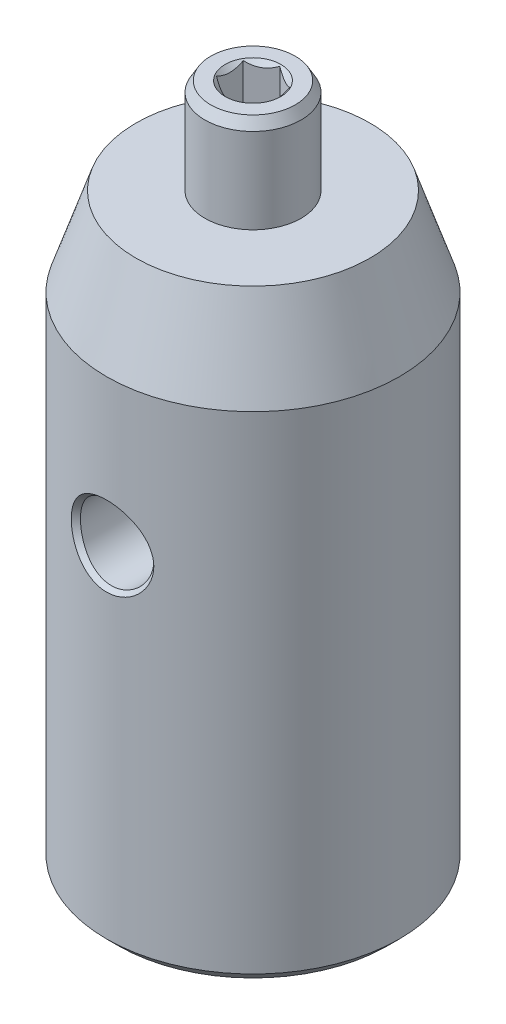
ISO-10303-21;
HEADER;
FILE_DESCRIPTION(('STEP AP214'),'2;1');
FILE_NAME('part.step','',(''),(''),'','','');
FILE_SCHEMA(('AUTOMOTIVE_DESIGN { 1 0 10303 214 1 1 1 1 }'));
ENDSEC;
DATA;
#1=APPLICATION_CONTEXT('core data for automotive mechanical design processes');
#2=APPLICATION_PROTOCOL_DEFINITION('international standard','automotive_design',2000,#1);
#3=PRODUCT_CONTEXT('',#1,'mechanical');
#4=PRODUCT('Part','Part','',(#3));
#5=PRODUCT_RELATED_PRODUCT_CATEGORY('part','',(#4));
#6=PRODUCT_DEFINITION_FORMATION('','',#4);
#7=PRODUCT_DEFINITION_CONTEXT('part definition',#1,'design');
#8=PRODUCT_DEFINITION('design','',#6,#7);
#9=PRODUCT_DEFINITION_SHAPE('','',#8);
#10=(LENGTH_UNIT() NAMED_UNIT(*) SI_UNIT(.MILLI.,.METRE.));
#11=(NAMED_UNIT(*) PLANE_ANGLE_UNIT() SI_UNIT($,.RADIAN.));
#12=(NAMED_UNIT(*) SI_UNIT($,.STERADIAN.) SOLID_ANGLE_UNIT());
#13=UNCERTAINTY_MEASURE_WITH_UNIT(LENGTH_MEASURE(1.E-05),#10,'distance_accuracy_value','');
#14=(GEOMETRIC_REPRESENTATION_CONTEXT(3) GLOBAL_UNCERTAINTY_ASSIGNED_CONTEXT((#13)) GLOBAL_UNIT_ASSIGNED_CONTEXT((#10,
#11,#12)) REPRESENTATION_CONTEXT('',''));
#15=CARTESIAN_POINT('',(0.,0.,0.));
#16=DIRECTION('',(0.,0.,1.));
#17=DIRECTION('',(1.,0.,0.));
#18=AXIS2_PLACEMENT_3D('',#15,#16,#17);
#19=CARTESIAN_POINT('',(1.58378725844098,29.5275,-0.914400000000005));
#20=DIRECTION('',(0.,-1.,0.));
#21=DIRECTION('',(-0.5,0.,-0.866025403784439));
#22=AXIS2_PLACEMENT_3D('',#19,#20,#21);
#23=PLANE('',#22);
#24=CARTESIAN_POINT('',(0.,29.5275,0.));
#25=DIRECTION('',(0.,-1.,0.));
#26=DIRECTION('',(-0.866025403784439,0.,0.5));
#27=AXIS2_PLACEMENT_3D('',#24,#25,#26);
#28=CIRCLE('',#27,1.2065);
#29=CARTESIAN_POINT('',(-1.04485964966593,29.5275,0.603249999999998));
#30=VERTEX_POINT('',#29);
#31=EDGE_CURVE('P0_E524',#30,#30,#28,.T.);
#32=ORIENTED_EDGE('',*,*,#31,.T.);
#33=EDGE_LOOP('',(#32));
#34=FACE_BOUND('',#33,.T.);
#35=CARTESIAN_POINT('',(0.,29.5275,0.));
#36=DIRECTION('',(0.,-1.,0.));
#37=DIRECTION('',(-0.5,0.,-0.866025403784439));
#38=AXIS2_PLACEMENT_3D('',#35,#36,#37);
#39=CIRCLE('',#38,1.8288);
#40=CARTESIAN_POINT('',(-0.914400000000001,29.5275,-1.58378725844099));
#41=VERTEX_POINT('',#40);
#42=EDGE_CURVE('P0_E167',#41,#41,#39,.T.);
#43=ORIENTED_EDGE('',*,*,#42,.F.);
#44=EDGE_LOOP('',(#43));
#45=FACE_BOUND('',#44,.T.);
#46=ADVANCED_FACE('P0_F16',(#34,#45),#23,.F.);
#47=CARTESIAN_POINT('',(0.,16.8275,0.));
#48=DIRECTION('',(0.,1.,0.));
#49=DIRECTION('',(0.5,0.,0.866025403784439));
#50=AXIS2_PLACEMENT_3D('',#47,#48,#49);
#51=PLANE('',#50);
#52=CARTESIAN_POINT('',(0.,16.8275,0.));
#53=DIRECTION('',(0.,-1.,0.));
#54=DIRECTION('',(-0.866025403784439,0.,0.5));
#55=AXIS2_PLACEMENT_3D('',#52,#53,#54);
#56=CIRCLE('',#55,1.20649999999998);
#57=CARTESIAN_POINT('',(-1.04485964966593,16.8275,0.603249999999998));
#58=VERTEX_POINT('',#57);
#59=EDGE_CURVE('P0_E130',#58,#58,#56,.T.);
#60=ORIENTED_EDGE('',*,*,#59,.F.);
#61=EDGE_LOOP('',(#60));
#62=FACE_BOUND('',#61,.T.);
#63=CARTESIAN_POINT('',(0.,16.8275,0.));
#64=DIRECTION('',(0.,-1.,0.));
#65=DIRECTION('',(-0.5,0.,-0.866025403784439));
#66=AXIS2_PLACEMENT_3D('',#63,#64,#65);
#67=CIRCLE('',#66,1.8288);
#68=CARTESIAN_POINT('',(-0.914400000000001,16.8275,-1.58378725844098));
#69=VERTEX_POINT('',#68);
#70=EDGE_CURVE('P0_E190',#69,#69,#67,.T.);
#71=ORIENTED_EDGE('',*,*,#70,.T.);
#72=EDGE_LOOP('',(#71));
#73=FACE_BOUND('',#72,.T.);
#74=ADVANCED_FACE('P0_F18',(#62,#73),#51,.F.);
#75=CARTESIAN_POINT('',(0.,17.2674409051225,0.));
#76=DIRECTION('',(0.,1.,0.));
#77=DIRECTION('',(0.5,0.,0.866025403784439));
#78=AXIS2_PLACEMENT_3D('',#75,#76,#77);
#79=CONICAL_SURFACE('',#78,2.0828,0.523598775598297);
#80=ORIENTED_EDGE('',*,*,#70,.F.);
#81=EDGE_LOOP('',(#80));
#82=FACE_BOUND('',#81,.T.);
#83=CARTESIAN_POINT('',(0.,17.2674409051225,0.));
#84=DIRECTION('',(0.,-1.,0.));
#85=DIRECTION('',(-0.5,0.,-0.866025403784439));
#86=AXIS2_PLACEMENT_3D('',#83,#84,#85);
#87=CIRCLE('',#86,2.0828);
#88=CARTESIAN_POINT('',(-1.0414,17.2674409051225,-1.80375771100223));
#89=VERTEX_POINT('',#88);
#90=EDGE_CURVE('P0_E187',#89,#89,#87,.T.);
#91=ORIENTED_EDGE('',*,*,#90,.T.);
#92=EDGE_LOOP('',(#91));
#93=FACE_BOUND('',#92,.T.);
#94=ADVANCED_FACE('P0_F277',(#82,#93),#79,.T.);
#95=CARTESIAN_POINT('',(0.,16.8275,0.));
#96=DIRECTION('',(0.,-1.,0.));
#97=DIRECTION('',(-0.5,0.,-0.866025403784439));
#98=AXIS2_PLACEMENT_3D('',#95,#96,#97);
#99=CYLINDRICAL_SURFACE('',#98,2.0828);
#100=ORIENTED_EDGE('',*,*,#90,.F.);
#101=EDGE_LOOP('',(#100));
#102=FACE_BOUND('',#101,.T.);
#103=CARTESIAN_POINT('',(0.,29.0875590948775,0.));
#104=DIRECTION('',(0.,-1.,0.));
#105=DIRECTION('',(-0.5,0.,-0.866025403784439));
#106=AXIS2_PLACEMENT_3D('',#103,#104,#105);
#107=CIRCLE('',#106,2.0828);
#108=CARTESIAN_POINT('',(-1.0414,29.0875590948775,-1.80375771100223));
#109=VERTEX_POINT('',#108);
#110=EDGE_CURVE('P0_E184',#109,#109,#107,.T.);
#111=ORIENTED_EDGE('',*,*,#110,.T.);
#112=EDGE_LOOP('',(#111));
#113=FACE_BOUND('',#112,.T.);
#114=ADVANCED_FACE('P0_F285',(#102,#113),#99,.T.);
#115=CARTESIAN_POINT('',(0.,29.5275,0.));
#116=DIRECTION('',(0.,-1.,0.));
#117=DIRECTION('',(-0.5,0.,-0.866025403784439));
#118=AXIS2_PLACEMENT_3D('',#115,#116,#117);
#119=CONICAL_SURFACE('',#118,1.8288,0.523598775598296);
#120=ORIENTED_EDGE('',*,*,#110,.F.);
#121=EDGE_LOOP('',(#120));
#122=FACE_BOUND('',#121,.T.);
#123=ORIENTED_EDGE('',*,*,#42,.T.);
#124=EDGE_LOOP('',(#123));
#125=FACE_BOUND('',#124,.T.);
#126=ADVANCED_FACE('P0_F206',(#122,#125),#119,.T.);
#127=CARTESIAN_POINT('',(0.,16.8275,0.));
#128=DIRECTION('',(0.,-1.,0.));
#129=DIRECTION('',(-0.866025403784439,0.,0.5));
#130=AXIS2_PLACEMENT_3D('',#127,#128,#129);
#131=CONICAL_SURFACE('',#130,1.20649999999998,0.785398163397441);
#132=ORIENTED_EDGE('',*,*,#59,.T.);
#133=EDGE_LOOP('',(#132));
#134=FACE_BOUND('',#133,.T.);
#135=CARTESIAN_POINT('',(-1.53100309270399,16.4785682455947,-0.274586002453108));
#136=CARTESIAN_POINT('',(-1.50606486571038,16.5005697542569,-0.288984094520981));
#137=CARTESIAN_POINT('',(-1.48099087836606,16.522365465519,-0.303460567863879));
#138=CARTESIAN_POINT('',(-1.43051525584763,16.5654593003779,-0.332602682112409));
#139=CARTESIAN_POINT('',(-1.40511354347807,16.5867573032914,-0.347268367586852));
#140=CARTESIAN_POINT('',(-1.32796072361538,16.6500799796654,-0.391812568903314));
#141=CARTESIAN_POINT('',(-1.27564046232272,16.6911951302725,-0.422019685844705));
#142=CARTESIAN_POINT('',(-1.16573655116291,16.7722215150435,-0.485472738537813));
#143=CARTESIAN_POINT('',(-1.10802647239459,16.811906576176,-0.518791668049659));
#144=CARTESIAN_POINT('',(-0.9896881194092,16.8847152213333,-0.587114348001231));
#145=CARTESIAN_POINT('',(-0.929070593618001,16.9178609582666,-0.622111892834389));
#146=CARTESIAN_POINT('',(-0.838355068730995,16.9584212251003,-0.674486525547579));
#147=CARTESIAN_POINT('',(-0.809661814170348,16.970004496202,-0.691052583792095));
#148=CARTESIAN_POINT('',(-0.751557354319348,16.9905147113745,-0.724599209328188));
#149=CARTESIAN_POINT('',(-0.722146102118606,16.9994414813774,-0.74157980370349));
#150=CARTESIAN_POINT('',(-0.663291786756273,17.0140150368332,-0.775559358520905));
#151=CARTESIAN_POINT('',(-0.633859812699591,17.019720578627,-0.792551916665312));
#152=CARTESIAN_POINT('',(-0.574639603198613,17.0277384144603,-0.826742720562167));
#153=CARTESIAN_POINT('',(-0.544851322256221,17.0300502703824,-0.843940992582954));
#154=CARTESIAN_POINT('',(-0.486442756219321,17.0310898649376,-0.877663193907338));
#155=CARTESIAN_POINT('',(-0.457824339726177,17.0299598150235,-0.894186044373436));
#156=CARTESIAN_POINT('',(-0.400828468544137,17.0245008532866,-0.927092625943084));
#157=CARTESIAN_POINT('',(-0.372450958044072,17.0201727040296,-0.943476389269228));
#158=CARTESIAN_POINT('',(-0.315646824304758,17.0084859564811,-0.976272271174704));
#159=CARTESIAN_POINT('',(-0.287228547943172,17.0010741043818,-0.992679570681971));
#160=CARTESIAN_POINT('',(-0.231016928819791,16.9836238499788,-1.02513336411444));
#161=CARTESIAN_POINT('',(-0.203223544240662,16.9735856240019,-1.04117988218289));
#162=CARTESIAN_POINT('',(-0.116989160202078,16.9386243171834,-1.09096732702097));
#163=CARTESIAN_POINT('',(-0.0597433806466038,16.9097814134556,-1.12401819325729));
#164=CARTESIAN_POINT('',(0.0520693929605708,16.8456143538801,-1.18857332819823));
#165=CARTESIAN_POINT('',(0.106625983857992,16.8102672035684,-1.22007159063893));
#166=CARTESIAN_POINT('',(0.210907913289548,16.7373017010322,-1.28027879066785));
#167=CARTESIAN_POINT('',(0.260738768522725,16.6998819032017,-1.30904864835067));
#168=CARTESIAN_POINT('',(0.334154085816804,16.6420168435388,-1.35143500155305));
#169=CARTESIAN_POINT('',(0.35830967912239,16.6225209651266,-1.36538123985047));
#170=CARTESIAN_POINT('',(0.406289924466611,16.5830088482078,-1.39308264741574));
#171=CARTESIAN_POINT('',(0.430114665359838,16.5629927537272,-1.40683786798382));
#172=CARTESIAN_POINT('',(0.453801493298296,16.5427608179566,-1.42051346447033));
#173=B_SPLINE_CURVE_WITH_KNOTS('',3,(#135,#136,#137,#138,#139,#140,#141,#142,#143,#144,#145,
#146,#147,#148,#149,#150,#151,#152,#153,#154,#155,#156,#157,#158,#159,#160,#161,#162,#163,#164,
#165,#166,#167,#168,#169,#170,#171,#172),.UNSPECIFIED.,.F.,.F.,(4,2,2,2,2,2,2,2,2,2,2,2,2,2,2,2,
2,2,4),(0.,0.108715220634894,0.217456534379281,0.436596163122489,0.669094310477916,
0.900790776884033,1.00599817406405,1.11121246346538,1.2144398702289,1.31768060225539,
1.41671434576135,1.51572448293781,1.61652052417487,1.71730980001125,1.9330395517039,
2.14954716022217,2.35535564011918,2.45744337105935,2.55950313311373),.UNSPECIFIED.);
#174=CARTESIAN_POINT('',(-1.0033,16.8754889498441,-0.579255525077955));
#175=VERTEX_POINT('',#174);
#176=CARTESIAN_POINT('',(0.,16.8754889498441,-1.15851105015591));
#177=VERTEX_POINT('',#176);
#178=EDGE_CURVE('P0_E235',#175,#177,#173,.T.);
#179=ORIENTED_EDGE('',*,*,#178,.F.);
#180=CARTESIAN_POINT('',(-1.0033,16.8753734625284,0.579486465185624));
#181=CARTESIAN_POINT('',(-1.0033,16.8952764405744,0.539653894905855));
#182=CARTESIAN_POINT('',(-1.0033,16.9140109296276,0.499155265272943));
#183=CARTESIAN_POINT('',(-1.0033,16.9483139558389,0.416573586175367));
#184=CARTESIAN_POINT('',(-1.0033,16.9638633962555,0.374482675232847));
#185=CARTESIAN_POINT('',(-1.0033,16.990500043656,0.289608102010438));
#186=CARTESIAN_POINT('',(-1.0033,17.0016542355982,0.246846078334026));
#187=CARTESIAN_POINT('',(-1.0033,17.0188406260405,0.160380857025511));
#188=CARTESIAN_POINT('',(-1.0033,17.0248856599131,0.116680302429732));
#189=CARTESIAN_POINT('',(-1.0033,17.0303377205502,0.0413677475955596));
#190=CARTESIAN_POINT('',(-1.0033,17.0311439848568,0.00985373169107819));
#191=CARTESIAN_POINT('',(-1.0033,17.0297897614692,-0.0531132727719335));
#192=CARTESIAN_POINT('',(-1.0033,17.0276286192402,-0.0845662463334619));
#193=CARTESIAN_POINT('',(-1.0033,17.0168368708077,-0.178476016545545));
#194=CARTESIAN_POINT('',(-1.0033,17.0038967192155,-0.240465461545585));
#195=CARTESIAN_POINT('',(-1.0033,16.9726678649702,-0.349263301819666));
#196=CARTESIAN_POINT('',(-1.0033,16.9560160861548,-0.396581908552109));
#197=CARTESIAN_POINT('',(-1.0033,16.9185057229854,-0.489365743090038));
#198=CARTESIAN_POINT('',(-1.0033,16.897660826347,-0.534836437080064));
#199=CARTESIAN_POINT('',(-1.0033,16.8753734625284,-0.579486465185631));
#200=B_SPLINE_CURVE_WITH_KNOTS('',3,(#180,#181,#182,#183,#184,#185,#186,#187,#188,#189,#190,
#191,#192,#193,#194,#195,#196,#197,#198,#199),.UNSPECIFIED.,.F.,.F.,(4,2,2,2,2,2,2,2,2,4),(0.,
0.133677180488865,0.268133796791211,0.400453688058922,0.532440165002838,0.626876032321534,
0.721332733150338,0.910299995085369,1.06058821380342,1.21039357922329),.UNSPECIFIED.);
#201=CARTESIAN_POINT('',(-1.0033,16.8754889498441,0.579255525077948));
#202=VERTEX_POINT('',#201);
#203=EDGE_CURVE('P0_E229',#202,#175,#200,.T.);
#204=ORIENTED_EDGE('',*,*,#203,.F.);
#205=CARTESIAN_POINT('',(0.000200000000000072,16.8753734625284,1.15862652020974));
#206=CARTESIAN_POINT('',(-0.0342960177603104,16.8952764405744,1.13871023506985));
#207=CARTESIAN_POINT('',(-0.0693688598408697,16.9140109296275,1.1184609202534));
#208=CARTESIAN_POINT('',(-0.140886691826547,16.9483139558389,1.07717008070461));
#209=CARTESIAN_POINT('',(-0.1773384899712,16.9638633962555,1.05612462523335));
#210=CARTESIAN_POINT('',(-0.250842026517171,16.990500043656,1.01368733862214));
#211=CARTESIAN_POINT('',(-0.287875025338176,17.0016542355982,0.992306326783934));
#212=CARTESIAN_POINT('',(-0.362756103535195,17.0188406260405,0.949073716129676));
#213=CARTESIAN_POINT('',(-0.40060189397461,17.0248856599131,0.927223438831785));
#214=CARTESIAN_POINT('',(-0.465824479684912,17.0303377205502,0.889567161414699));
#215=CARTESIAN_POINT('',(-0.49311641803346,17.0311439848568,0.873810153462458));
#216=CARTESIAN_POINT('',(-0.547647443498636,17.0297897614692,0.842326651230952));
#217=CARTESIAN_POINT('',(-0.57488651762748,17.0276286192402,0.826600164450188));
#218=CARTESIAN_POINT('',(-0.656214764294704,17.0168368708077,0.779645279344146));
#219=CARTESIAN_POINT('',(-0.709899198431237,17.0038967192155,0.748650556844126));
#220=CARTESIAN_POINT('',(-0.804120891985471,16.9726678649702,0.694251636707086));
#221=CARTESIAN_POINT('',(-0.84510000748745,16.9560160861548,0.670592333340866));
#222=CARTESIAN_POINT('',(-0.925453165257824,16.9185057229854,0.624200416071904));
#223=CARTESIAN_POINT('',(-0.964831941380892,16.897660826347,0.601465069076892));
#224=CARTESIAN_POINT('',(-1.0035,16.8753734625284,0.579140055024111));
#225=B_SPLINE_CURVE_WITH_KNOTS('',3,(#205,#206,#207,#208,#209,#210,#211,#212,#213,#214,#215,
#216,#217,#218,#219,#220,#221,#222,#223,#224),.UNSPECIFIED.,.F.,.F.,(4,2,2,2,2,2,2,2,2,4),(0.,
0.133677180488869,0.268133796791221,0.400453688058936,0.532440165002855,0.626876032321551,
0.721332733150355,0.910299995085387,1.06058821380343,1.21039357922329),.UNSPECIFIED.);
#226=CARTESIAN_POINT('',(0.,16.8754889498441,1.1585110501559));
#227=VERTEX_POINT('',#226);
#228=EDGE_CURVE('P0_E223',#227,#202,#225,.T.);
#229=ORIENTED_EDGE('',*,*,#228,.F.);
#230=CARTESIAN_POINT('',(-0.527703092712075,16.4785682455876,1.46318057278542));
#231=CARTESIAN_POINT('',(-0.502764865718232,16.50056975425,1.44878248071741));
#232=CARTESIAN_POINT('',(-0.477690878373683,16.5223654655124,1.43430600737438));
#233=CARTESIAN_POINT('',(-0.427215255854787,16.5654593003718,1.40516389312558));
#234=CARTESIAN_POINT('',(-0.401813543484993,16.5867573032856,1.390498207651));
#235=CARTESIAN_POINT('',(-0.324660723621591,16.6500799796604,1.34595400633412));
#236=CARTESIAN_POINT('',(-0.272340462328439,16.6911951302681,1.31574688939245));
#237=CARTESIAN_POINT('',(-0.162436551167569,16.7722215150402,1.25229383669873));
#238=CARTESIAN_POINT('',(-0.104726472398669,16.8119065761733,1.21897490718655));
#239=CARTESIAN_POINT('',(0.0136118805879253,16.8847152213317,1.15065222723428));
#240=CARTESIAN_POINT('',(0.0742294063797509,16.9178609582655,1.11565468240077));
#241=CARTESIAN_POINT('',(0.164944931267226,16.9584212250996,1.0632800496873));
#242=CARTESIAN_POINT('',(0.193638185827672,16.9700044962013,1.0467139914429));
#243=CARTESIAN_POINT('',(0.251742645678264,16.9905147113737,1.01316736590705));
#244=CARTESIAN_POINT('',(0.281153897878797,16.9994414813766,0.996186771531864));
#245=CARTESIAN_POINT('',(0.340008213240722,17.0140150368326,0.962207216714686));
#246=CARTESIAN_POINT('',(0.369440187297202,17.0197205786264,0.945214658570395));
#247=CARTESIAN_POINT('',(0.428660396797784,17.0277384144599,0.911023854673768));
#248=CARTESIAN_POINT('',(0.458448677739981,17.0300502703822,0.893825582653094));
#249=CARTESIAN_POINT('',(0.516857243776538,17.0310898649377,0.860103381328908));
#250=CARTESIAN_POINT('',(0.545475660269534,17.0299598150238,0.843580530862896));
#251=CARTESIAN_POINT('',(0.602471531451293,17.0245008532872,0.81067394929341));
#252=CARTESIAN_POINT('',(0.630849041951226,17.0201727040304,0.794290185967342));
#253=CARTESIAN_POINT('',(0.687653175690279,17.0084859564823,0.761494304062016));
#254=CARTESIAN_POINT('',(0.716071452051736,17.0010741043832,0.745087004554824));
#255=CARTESIAN_POINT('',(0.772283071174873,16.9836238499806,0.712633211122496));
#256=CARTESIAN_POINT('',(0.800076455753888,16.9735856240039,0.696586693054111));
#257=CARTESIAN_POINT('',(0.886310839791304,16.9386243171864,0.646799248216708));
#258=CARTESIAN_POINT('',(0.943556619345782,16.9097814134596,0.61374838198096));
#259=CARTESIAN_POINT('',(1.05536939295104,16.8456143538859,0.549193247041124));
#260=CARTESIAN_POINT('',(1.10992598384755,16.8102672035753,0.51769498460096));
#261=CARTESIAN_POINT('',(1.21420791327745,16.7373017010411,0.457487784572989));
#262=CARTESIAN_POINT('',(1.26403876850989,16.6998819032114,0.42871792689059));
#263=CARTESIAN_POINT('',(1.33745408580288,16.6420168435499,0.386331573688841));
#264=CARTESIAN_POINT('',(1.36160967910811,16.6225209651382,0.372385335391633));
#265=CARTESIAN_POINT('',(1.40958992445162,16.5830088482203,0.344683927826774));
#266=CARTESIAN_POINT('',(1.43341466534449,16.5629927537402,0.330928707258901));
#267=CARTESIAN_POINT('',(1.4571014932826,16.54276081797,0.317253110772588));
#268=B_SPLINE_CURVE_WITH_KNOTS('',3,(#230,#231,#232,#233,#234,#235,#236,#237,#238,#239,#240,
#241,#242,#243,#244,#245,#246,#247,#248,#249,#250,#251,#252,#253,#254,#255,#256,#257,#258,#259,
#260,#261,#262,#263,#264,#265,#266,#267),.UNSPECIFIED.,.F.,.F.,(4,2,2,2,2,2,2,2,2,2,2,2,2,2,2,2,
2,2,4),(0.,0.108715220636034,0.217456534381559,0.436596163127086,0.669094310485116,
0.900790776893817,1.00599817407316,1.11121246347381,1.21443987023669,1.31768060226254,
1.41671434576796,1.51572448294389,1.61652052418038,1.71730980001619,1.9330395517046,
2.1495471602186,2.35535564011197,2.45744337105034,2.55950313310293),.UNSPECIFIED.);
#269=CARTESIAN_POINT('',(1.0033,16.8754889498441,0.579255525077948));
#270=VERTEX_POINT('',#269);
#271=EDGE_CURVE('P0_E43',#270,#227,#268,.F.);
#272=ORIENTED_EDGE('',*,*,#271,.F.);
#273=CARTESIAN_POINT('',(1.0033,16.8753734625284,-0.579486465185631));
#274=CARTESIAN_POINT('',(1.0033,16.8952764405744,-0.539653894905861));
#275=CARTESIAN_POINT('',(1.0033,16.9140109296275,-0.499155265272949));
#276=CARTESIAN_POINT('',(1.0033,16.9483139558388,-0.41657358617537));
#277=CARTESIAN_POINT('',(1.0033,16.9638633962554,-0.374482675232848));
#278=CARTESIAN_POINT('',(1.0033,16.990500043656,-0.289608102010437));
#279=CARTESIAN_POINT('',(1.0033,17.0016542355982,-0.246846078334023));
#280=CARTESIAN_POINT('',(1.0033,17.0188406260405,-0.160380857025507));
#281=CARTESIAN_POINT('',(1.0033,17.024885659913,-0.116680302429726));
#282=CARTESIAN_POINT('',(1.0033,17.0303377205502,-0.041367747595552));
#283=CARTESIAN_POINT('',(1.0033,17.0311439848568,-0.00985373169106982));
#284=CARTESIAN_POINT('',(1.0033,17.0297897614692,0.0531132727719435));
#285=CARTESIAN_POINT('',(1.0033,17.0276286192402,0.0845662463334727));
#286=CARTESIAN_POINT('',(1.0033,17.0168368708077,0.178476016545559));
#287=CARTESIAN_POINT('',(1.0033,17.0038967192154,0.2404654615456));
#288=CARTESIAN_POINT('',(1.0033,16.9726678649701,0.349263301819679));
#289=CARTESIAN_POINT('',(1.0033,16.9560160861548,0.396581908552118));
#290=CARTESIAN_POINT('',(1.0033,16.9185057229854,0.489365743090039));
#291=CARTESIAN_POINT('',(1.0033,16.897660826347,0.534836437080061));
#292=CARTESIAN_POINT('',(1.0033,16.8753734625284,0.579486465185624));
#293=B_SPLINE_CURVE_WITH_KNOTS('',3,(#273,#274,#275,#276,#277,#278,#279,#280,#281,#282,#283,
#284,#285,#286,#287,#288,#289,#290,#291,#292),.UNSPECIFIED.,.F.,.F.,(4,2,2,2,2,2,2,2,2,4),(0.,
0.133677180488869,0.268133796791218,0.400453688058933,0.532440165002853,0.626876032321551,
0.721332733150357,0.910299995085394,1.06058821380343,1.21039357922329),.UNSPECIFIED.);
#294=CARTESIAN_POINT('',(1.0033,16.8754889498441,-0.579255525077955));
#295=VERTEX_POINT('',#294);
#296=EDGE_CURVE('P0_E29',#295,#270,#293,.T.);
#297=ORIENTED_EDGE('',*,*,#296,.F.);
#298=CARTESIAN_POINT('',(-0.000200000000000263,16.8753734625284,-1.15862652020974));
#299=CARTESIAN_POINT('',(0.0342960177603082,16.8952764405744,-1.13871023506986));
#300=CARTESIAN_POINT('',(0.0693688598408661,16.9140109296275,-1.1184609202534));
#301=CARTESIAN_POINT('',(0.140886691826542,16.9483139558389,-1.07717008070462));
#302=CARTESIAN_POINT('',(0.177338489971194,16.9638633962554,-1.05612462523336));
#303=CARTESIAN_POINT('',(0.250842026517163,16.990500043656,-1.01368733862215));
#304=CARTESIAN_POINT('',(0.287875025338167,17.0016542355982,-0.992306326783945));
#305=CARTESIAN_POINT('',(0.362756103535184,17.0188406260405,-0.949073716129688));
#306=CARTESIAN_POINT('',(0.400601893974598,17.024885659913,-0.927223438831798));
#307=CARTESIAN_POINT('',(0.465824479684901,17.0303377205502,-0.889567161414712));
#308=CARTESIAN_POINT('',(0.493116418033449,17.0311439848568,-0.873810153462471));
#309=CARTESIAN_POINT('',(0.547647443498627,17.0297897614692,-0.842326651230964));
#310=CARTESIAN_POINT('',(0.574886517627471,17.0276286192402,-0.826600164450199));
#311=CARTESIAN_POINT('',(0.656214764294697,17.0168368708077,-0.779645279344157));
#312=CARTESIAN_POINT('',(0.70989919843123,17.0038967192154,-0.748650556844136));
#313=CARTESIAN_POINT('',(0.804120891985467,16.9726678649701,-0.694251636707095));
#314=CARTESIAN_POINT('',(0.845100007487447,16.9560160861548,-0.670592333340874));
#315=CARTESIAN_POINT('',(0.925453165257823,16.9185057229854,-0.624200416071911));
#316=CARTESIAN_POINT('',(0.964831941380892,16.897660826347,-0.601465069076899));
#317=CARTESIAN_POINT('',(1.0035,16.8753734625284,-0.579140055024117));
#318=B_SPLINE_CURVE_WITH_KNOTS('',3,(#298,#299,#300,#301,#302,#303,#304,#305,#306,#307,#308,
#309,#310,#311,#312,#313,#314,#315,#316,#317),.UNSPECIFIED.,.F.,.F.,(4,2,2,2,2,2,2,2,2,4),(0.,
0.133677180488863,0.268133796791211,0.400453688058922,0.532440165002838,0.626876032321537,
0.721332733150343,0.91029999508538,1.06058821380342,1.21039357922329),.UNSPECIFIED.);
#319=EDGE_CURVE('P0_E241',#177,#295,#318,.T.);
#320=ORIENTED_EDGE('',*,*,#319,.F.);
#321=EDGE_LOOP('',(#179,#204,#229,#272,#297,#320));
#322=FACE_BOUND('',#321,.T.);
#323=ADVANCED_FACE('P0_F201',(#134,#322),#131,.F.);
#324=CARTESIAN_POINT('',(0.,19.6215,0.));
#325=DIRECTION('',(0.,-1.,0.));
#326=DIRECTION('',(-0.5,0.,-0.866025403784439));
#327=AXIS2_PLACEMENT_3D('',#324,#325,#326);
#328=CONICAL_SURFACE('',#327,0.992251,1.02974425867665);
#329=CARTESIAN_POINT('',(0.,20.2177045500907,0.));
#330=VERTEX_POINT('',#329);
#331=VERTEX_LOOP('',#330);
#332=FACE_BOUND('',#331,.T.);
#333=CARTESIAN_POINT('',(0.,19.6215,0.));
#334=DIRECTION('',(0.,-1.,0.));
#335=DIRECTION('',(-0.5,0.,-0.866025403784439));
#336=AXIS2_PLACEMENT_3D('',#333,#334,#335);
#337=CIRCLE('',#336,0.992251);
#338=CARTESIAN_POINT('',(-0.4961255,19.6215,-0.859314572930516));
#339=VERTEX_POINT('',#338);
#340=EDGE_CURVE('P0_E476',#339,#339,#337,.T.);
#341=ORIENTED_EDGE('',*,*,#340,.T.);
#342=EDGE_LOOP('',(#341));
#343=FACE_BOUND('',#342,.T.);
#344=ADVANCED_FACE('P0_F205',(#332,#343),#328,.F.);
#345=CARTESIAN_POINT('',(2.0066,19.6215,0.));
#346=DIRECTION('',(0.,-1.,0.));
#347=DIRECTION('',(-0.5,0.,-0.866025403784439));
#348=AXIS2_PLACEMENT_3D('',#345,#346,#347);
#349=PLANE('',#348);
#350=ORIENTED_EDGE('',*,*,#340,.F.);
#351=EDGE_LOOP('',(#350));
#352=FACE_BOUND('',#351,.T.);
#353=DIRECTION('',(0.866025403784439,0.,0.5));
#354=VECTOR('',#353,1.);
#355=CARTESIAN_POINT('',(0.,19.6215,-1.15851105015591));
#356=LINE('',#355,#354);
#357=CARTESIAN_POINT('',(0.,19.6215,-1.15851105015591));
#358=VERTEX_POINT('',#357);
#359=CARTESIAN_POINT('',(1.0033,19.6215,-0.579255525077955));
#360=VERTEX_POINT('',#359);
#361=EDGE_CURVE('P0_E145',#358,#360,#356,.T.);
#362=ORIENTED_EDGE('',*,*,#361,.T.);
#363=DIRECTION('',(0.,0.,1.));
#364=VECTOR('',#363,1.);
#365=CARTESIAN_POINT('',(1.0033,19.6215,-0.579255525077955));
#366=LINE('',#365,#364);
#367=CARTESIAN_POINT('',(1.0033,19.6215,0.579255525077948));
#368=VERTEX_POINT('',#367);
#369=EDGE_CURVE('P0_E148',#360,#368,#366,.T.);
#370=ORIENTED_EDGE('',*,*,#369,.T.);
#371=DIRECTION('',(-0.866025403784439,0.,0.5));
#372=VECTOR('',#371,1.);
#373=CARTESIAN_POINT('',(1.0033,19.6215,0.579255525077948));
#374=LINE('',#373,#372);
#375=CARTESIAN_POINT('',(0.,19.6215,1.1585110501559));
#376=VERTEX_POINT('',#375);
#377=EDGE_CURVE('P0_E151',#368,#376,#374,.T.);
#378=ORIENTED_EDGE('',*,*,#377,.T.);
#379=DIRECTION('',(-0.866025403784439,0.,-0.5));
#380=VECTOR('',#379,1.);
#381=CARTESIAN_POINT('',(0.,19.6215,1.1585110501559));
#382=LINE('',#381,#380);
#383=CARTESIAN_POINT('',(-1.0033,19.6215,0.579255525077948));
#384=VERTEX_POINT('',#383);
#385=EDGE_CURVE('P0_E154',#376,#384,#382,.T.);
#386=ORIENTED_EDGE('',*,*,#385,.T.);
#387=DIRECTION('',(0.,0.,-1.));
#388=VECTOR('',#387,1.);
#389=CARTESIAN_POINT('',(-1.0033,19.6215,0.579255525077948));
#390=LINE('',#389,#388);
#391=CARTESIAN_POINT('',(-1.0033,19.6215,-0.579255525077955));
#392=VERTEX_POINT('',#391);
#393=EDGE_CURVE('P0_E157',#384,#392,#390,.T.);
#394=ORIENTED_EDGE('',*,*,#393,.T.);
#395=DIRECTION('',(0.866025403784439,0.,-0.5));
#396=VECTOR('',#395,1.);
#397=CARTESIAN_POINT('',(-1.0033,19.6215,-0.579255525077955));
#398=LINE('',#397,#396);
#399=EDGE_CURVE('P0_E160',#392,#358,#398,.T.);
#400=ORIENTED_EDGE('',*,*,#399,.T.);
#401=EDGE_LOOP('',(#362,#370,#378,#386,#394,#400));
#402=FACE_BOUND('',#401,.T.);
#403=ADVANCED_FACE('P0_F253',(#352,#402),#349,.T.);
#404=CARTESIAN_POINT('',(1.0033,19.6215,-0.579255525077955));
#405=DIRECTION('',(1.,0.,0.));
#406=DIRECTION('',(0.,0.,1.));
#407=AXIS2_PLACEMENT_3D('',#404,#405,#406);
#408=PLANE('',#407);
#409=DIRECTION('',(0.,-1.,0.));
#410=VECTOR('',#409,1.);
#411=CARTESIAN_POINT('',(1.0033,19.6215,-0.579255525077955));
#412=LINE('',#411,#410);
#413=EDGE_CURVE('P0_E163',#360,#295,#412,.T.);
#414=ORIENTED_EDGE('',*,*,#413,.T.);
#415=ORIENTED_EDGE('',*,*,#296,.T.);
#416=DIRECTION('',(0.,-1.,0.));
#417=VECTOR('',#416,1.);
#418=CARTESIAN_POINT('',(1.0033,19.6215,0.579255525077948));
#419=LINE('',#418,#417);
#420=EDGE_CURVE('P0_E177',#368,#270,#419,.T.);
#421=ORIENTED_EDGE('',*,*,#420,.F.);
#422=ORIENTED_EDGE('',*,*,#369,.F.);
#423=EDGE_LOOP('',(#414,#415,#421,#422));
#424=FACE_BOUND('',#423,.T.);
#425=ADVANCED_FACE('P0_F197',(#424),#408,.F.);
#426=CARTESIAN_POINT('',(1.0033,19.6215,0.579255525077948));
#427=DIRECTION('',(0.5,0.,0.866025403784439));
#428=DIRECTION('',(-0.866025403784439,0.,0.5));
#429=AXIS2_PLACEMENT_3D('',#426,#427,#428);
#430=PLANE('',#429);
#431=ORIENTED_EDGE('',*,*,#420,.T.);
#432=ORIENTED_EDGE('',*,*,#271,.T.);
#433=DIRECTION('',(0.,-1.,0.));
#434=VECTOR('',#433,1.);
#435=CARTESIAN_POINT('',(0.,19.6215,1.1585110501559));
#436=LINE('',#435,#434);
#437=EDGE_CURVE('P0_E174',#376,#227,#436,.T.);
#438=ORIENTED_EDGE('',*,*,#437,.F.);
#439=ORIENTED_EDGE('',*,*,#377,.F.);
#440=EDGE_LOOP('',(#431,#432,#438,#439));
#441=FACE_BOUND('',#440,.T.);
#442=ADVANCED_FACE('P0_F261',(#441),#430,.F.);
#443=CARTESIAN_POINT('',(0.,19.6215,1.1585110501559));
#444=DIRECTION('',(-0.5,0.,0.866025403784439));
#445=DIRECTION('',(-0.866025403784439,0.,-0.5));
#446=AXIS2_PLACEMENT_3D('',#443,#444,#445);
#447=PLANE('',#446);
#448=ORIENTED_EDGE('',*,*,#437,.T.);
#449=ORIENTED_EDGE('',*,*,#228,.T.);
#450=DIRECTION('',(0.,-1.,0.));
#451=VECTOR('',#450,1.);
#452=CARTESIAN_POINT('',(-1.0033,19.6215,0.579255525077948));
#453=LINE('',#452,#451);
#454=EDGE_CURVE('P0_E171',#384,#202,#453,.T.);
#455=ORIENTED_EDGE('',*,*,#454,.F.);
#456=ORIENTED_EDGE('',*,*,#385,.F.);
#457=EDGE_LOOP('',(#448,#449,#455,#456));
#458=FACE_BOUND('',#457,.T.);
#459=ADVANCED_FACE('P0_F257',(#458),#447,.F.);
#460=CARTESIAN_POINT('',(-1.0033,19.6215,0.579255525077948));
#461=DIRECTION('',(-1.,0.,0.));
#462=DIRECTION('',(0.,0.,-1.));
#463=AXIS2_PLACEMENT_3D('',#460,#461,#462);
#464=PLANE('',#463);
#465=ORIENTED_EDGE('',*,*,#454,.T.);
#466=ORIENTED_EDGE('',*,*,#203,.T.);
#467=DIRECTION('',(0.,-1.,0.));
#468=VECTOR('',#467,1.);
#469=CARTESIAN_POINT('',(-1.0033,19.6215,-0.579255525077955));
#470=LINE('',#469,#468);
#471=EDGE_CURVE('P0_E168',#392,#175,#470,.T.);
#472=ORIENTED_EDGE('',*,*,#471,.F.);
#473=ORIENTED_EDGE('',*,*,#393,.F.);
#474=EDGE_LOOP('',(#465,#466,#472,#473));
#475=FACE_BOUND('',#474,.T.);
#476=ADVANCED_FACE('P0_F251',(#475),#464,.F.);
#477=CARTESIAN_POINT('',(-1.0033,19.6215,-0.579255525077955));
#478=DIRECTION('',(-0.5,0.,-0.866025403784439));
#479=DIRECTION('',(0.866025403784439,0.,-0.5));
#480=AXIS2_PLACEMENT_3D('',#477,#478,#479);
#481=PLANE('',#480);
#482=ORIENTED_EDGE('',*,*,#471,.T.);
#483=ORIENTED_EDGE('',*,*,#178,.T.);
#484=DIRECTION('',(0.,-1.,0.));
#485=VECTOR('',#484,1.);
#486=CARTESIAN_POINT('',(0.,19.6215,-1.15851105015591));
#487=LINE('',#486,#485);
#488=EDGE_CURVE('P0_E164',#358,#177,#487,.T.);
#489=ORIENTED_EDGE('',*,*,#488,.F.);
#490=ORIENTED_EDGE('',*,*,#399,.F.);
#491=EDGE_LOOP('',(#482,#483,#489,#490));
#492=FACE_BOUND('',#491,.T.);
#493=ADVANCED_FACE('P0_F246',(#492),#481,.F.);
#494=CARTESIAN_POINT('',(0.,19.6215,-1.15851105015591));
#495=DIRECTION('',(0.5,0.,-0.866025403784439));
#496=DIRECTION('',(0.866025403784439,0.,0.5));
#497=AXIS2_PLACEMENT_3D('',#494,#495,#496);
#498=PLANE('',#497);
#499=ORIENTED_EDGE('',*,*,#488,.T.);
#500=ORIENTED_EDGE('',*,*,#319,.T.);
#501=ORIENTED_EDGE('',*,*,#413,.F.);
#502=ORIENTED_EDGE('',*,*,#361,.F.);
#503=EDGE_LOOP('',(#499,#500,#501,#502));
#504=FACE_BOUND('',#503,.T.);
#505=ADVANCED_FACE('P0_F250',(#504),#498,.F.);
#506=CARTESIAN_POINT('',(0.,28.321,0.));
#507=DIRECTION('',(0.,1.,0.));
#508=DIRECTION('',(0.866025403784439,0.,-0.5));
#509=AXIS2_PLACEMENT_3D('',#506,#507,#508);
#510=CONICAL_SURFACE('',#509,0.,0.785398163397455);
#511=CARTESIAN_POINT('',(-0.000200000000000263,29.4796265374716,-1.15862652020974));
#512=CARTESIAN_POINT('',(0.0342960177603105,29.4597235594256,-1.13871023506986));
#513=CARTESIAN_POINT('',(0.0693688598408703,29.4409890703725,-1.1184609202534));
#514=CARTESIAN_POINT('',(0.140886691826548,29.4066860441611,-1.07717008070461));
#515=CARTESIAN_POINT('',(0.177338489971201,29.3911366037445,-1.05612462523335));
#516=CARTESIAN_POINT('',(0.250842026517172,29.364499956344,-1.01368733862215));
#517=CARTESIAN_POINT('',(0.287875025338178,29.3533457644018,-0.992306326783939));
#518=CARTESIAN_POINT('',(0.362756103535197,29.3361593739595,-0.949073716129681));
#519=CARTESIAN_POINT('',(0.400601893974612,29.330114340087,-0.92722343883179));
#520=CARTESIAN_POINT('',(0.465824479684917,29.3246622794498,-0.889567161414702));
#521=CARTESIAN_POINT('',(0.493116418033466,29.3238560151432,-0.873810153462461));
#522=CARTESIAN_POINT('',(0.547647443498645,29.3252102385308,-0.842326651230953));
#523=CARTESIAN_POINT('',(0.574886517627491,29.3273713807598,-0.826600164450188));
#524=CARTESIAN_POINT('',(0.656214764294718,29.3381631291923,-0.779645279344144));
#525=CARTESIAN_POINT('',(0.709899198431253,29.3511032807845,-0.748650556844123));
#526=CARTESIAN_POINT('',(0.804120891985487,29.3823321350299,-0.694251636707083));
#527=CARTESIAN_POINT('',(0.845100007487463,29.3989839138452,-0.670592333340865));
#528=CARTESIAN_POINT('',(0.925453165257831,29.4364942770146,-0.624200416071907));
#529=CARTESIAN_POINT('',(0.964831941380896,29.457339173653,-0.601465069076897));
#530=CARTESIAN_POINT('',(1.0035,29.4796265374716,-0.579140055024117));
#531=B_SPLINE_CURVE_WITH_KNOTS('',3,(#511,#512,#513,#514,#515,#516,#517,#518,#519,#520,#521,
#522,#523,#524,#525,#526,#527,#528,#529,#530),.UNSPECIFIED.,.F.,.F.,(4,2,2,2,2,2,2,2,2,4),(0.,
0.133677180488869,0.268133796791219,0.400453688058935,0.532440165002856,0.626876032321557,
0.721332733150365,0.910299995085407,1.06058821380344,1.21039357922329),.UNSPECIFIED.);
#532=CARTESIAN_POINT('',(0.,29.4795110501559,-1.15851105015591));
#533=VERTEX_POINT('',#532);
#534=CARTESIAN_POINT('',(1.0033,29.4795110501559,-0.579255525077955));
#535=VERTEX_POINT('',#534);
#536=EDGE_CURVE('P0_E115',#533,#535,#531,.T.);
#537=ORIENTED_EDGE('',*,*,#536,.T.);
#538=CARTESIAN_POINT('',(1.0033,29.4796265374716,-0.579486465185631));
#539=CARTESIAN_POINT('',(1.0033,29.4597235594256,-0.539653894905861));
#540=CARTESIAN_POINT('',(1.0033,29.4409890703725,-0.499155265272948));
#541=CARTESIAN_POINT('',(1.0033,29.4066860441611,-0.416573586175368));
#542=CARTESIAN_POINT('',(1.0033,29.3911366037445,-0.374482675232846));
#543=CARTESIAN_POINT('',(1.0033,29.364499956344,-0.289608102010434));
#544=CARTESIAN_POINT('',(1.0033,29.3533457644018,-0.24684607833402));
#545=CARTESIAN_POINT('',(1.0033,29.3361593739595,-0.160380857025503));
#546=CARTESIAN_POINT('',(1.0033,29.330114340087,-0.116680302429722));
#547=CARTESIAN_POINT('',(1.0033,29.3246622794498,-0.0413677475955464));
#548=CARTESIAN_POINT('',(1.0033,29.3238560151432,-0.00985373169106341));
#549=CARTESIAN_POINT('',(1.0033,29.3252102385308,0.0531132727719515));
#550=CARTESIAN_POINT('',(1.0033,29.3273713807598,0.0845662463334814));
#551=CARTESIAN_POINT('',(1.0033,29.3381631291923,0.17847601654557));
#552=CARTESIAN_POINT('',(1.0033,29.3511032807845,0.240465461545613));
#553=CARTESIAN_POINT('',(1.0033,29.3823321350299,0.349263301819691));
#554=CARTESIAN_POINT('',(1.0033,29.3989839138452,0.396581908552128));
#555=CARTESIAN_POINT('',(1.0033,29.4364942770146,0.489365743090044));
#556=CARTESIAN_POINT('',(1.0033,29.457339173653,0.534836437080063));
#557=CARTESIAN_POINT('',(1.0033,29.4796265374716,0.579486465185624));
#558=B_SPLINE_CURVE_WITH_KNOTS('',3,(#538,#539,#540,#541,#542,#543,#544,#545,#546,#547,#548,
#549,#550,#551,#552,#553,#554,#555,#556,#557),.UNSPECIFIED.,.F.,.F.,(4,2,2,2,2,2,2,2,2,4),(0.,
0.13367718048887,0.268133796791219,0.400453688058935,0.532440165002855,0.626876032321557,
0.721332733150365,0.910299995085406,1.06058821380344,1.21039357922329),.UNSPECIFIED.);
#559=CARTESIAN_POINT('',(1.0033,29.4795110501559,0.579255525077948));
#560=VERTEX_POINT('',#559);
#561=EDGE_CURVE('P0_E131',#535,#560,#558,.T.);
#562=ORIENTED_EDGE('',*,*,#561,.T.);
#563=CARTESIAN_POINT('',(-0.527703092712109,29.8764317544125,1.46318057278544));
#564=CARTESIAN_POINT('',(-0.502764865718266,29.85443024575,1.44878248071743));
#565=CARTESIAN_POINT('',(-0.477690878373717,29.8326345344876,1.43430600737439));
#566=CARTESIAN_POINT('',(-0.427215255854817,29.7895406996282,1.40516389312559));
#567=CARTESIAN_POINT('',(-0.401813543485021,29.7682426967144,1.39049820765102));
#568=CARTESIAN_POINT('',(-0.324660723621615,29.7049200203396,1.34595400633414));
#569=CARTESIAN_POINT('',(-0.27234046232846,29.6638048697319,1.31574688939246));
#570=CARTESIAN_POINT('',(-0.162436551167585,29.5827784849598,1.25229383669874));
#571=CARTESIAN_POINT('',(-0.104726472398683,29.5430934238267,1.21897490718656));
#572=CARTESIAN_POINT('',(0.0136118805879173,29.4702847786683,1.15065222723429));
#573=CARTESIAN_POINT('',(0.0742294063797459,29.4371390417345,1.11565468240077));
#574=CARTESIAN_POINT('',(0.164944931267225,29.3965787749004,1.0632800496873));
#575=CARTESIAN_POINT('',(0.193638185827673,29.3849955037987,1.0467139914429));
#576=CARTESIAN_POINT('',(0.251742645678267,29.3644852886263,1.01316736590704));
#577=CARTESIAN_POINT('',(0.281153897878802,29.3555585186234,0.996186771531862));
#578=CARTESIAN_POINT('',(0.340008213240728,29.3409849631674,0.962207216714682));
#579=CARTESIAN_POINT('',(0.36944018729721,29.3352794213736,0.94521465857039));
#580=CARTESIAN_POINT('',(0.428660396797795,29.32726158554,0.911023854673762));
#581=CARTESIAN_POINT('',(0.458448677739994,29.3249497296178,0.893825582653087));
#582=CARTESIAN_POINT('',(0.516857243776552,29.3239101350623,0.8601033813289));
#583=CARTESIAN_POINT('',(0.54547566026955,29.3250401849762,0.843580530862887));
#584=CARTESIAN_POINT('',(0.602471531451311,29.3304991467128,0.810673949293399));
#585=CARTESIAN_POINT('',(0.630849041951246,29.3348272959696,0.794290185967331));
#586=CARTESIAN_POINT('',(0.6876531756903,29.3465140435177,0.761494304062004));
#587=CARTESIAN_POINT('',(0.716071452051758,29.3539258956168,0.745087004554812));
#588=CARTESIAN_POINT('',(0.772283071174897,29.3713761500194,0.712633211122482));
#589=CARTESIAN_POINT('',(0.800076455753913,29.3814143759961,0.696586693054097));
#590=CARTESIAN_POINT('',(0.886310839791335,29.4163756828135,0.64679924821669));
#591=CARTESIAN_POINT('',(0.943556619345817,29.4452185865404,0.613748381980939));
#592=CARTESIAN_POINT('',(1.05536939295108,29.5093856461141,0.5491932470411));
#593=CARTESIAN_POINT('',(1.10992598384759,29.5447327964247,0.517694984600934));
#594=CARTESIAN_POINT('',(1.2142079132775,29.6176982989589,0.45748778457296));
#595=CARTESIAN_POINT('',(1.26403876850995,29.6551180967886,0.428717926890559));
#596=CARTESIAN_POINT('',(1.33745408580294,29.7129831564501,0.386331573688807));
#597=CARTESIAN_POINT('',(1.36160967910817,29.7324790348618,0.372385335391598));
#598=CARTESIAN_POINT('',(1.40958992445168,29.7719911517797,0.344683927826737));
#599=CARTESIAN_POINT('',(1.43341466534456,29.7920072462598,0.330928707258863));
#600=CARTESIAN_POINT('',(1.45710149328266,29.81223918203,0.317253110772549));
#601=B_SPLINE_CURVE_WITH_KNOTS('',3,(#563,#564,#565,#566,#567,#568,#569,#570,#571,#572,#573,
#574,#575,#576,#577,#578,#579,#580,#581,#582,#583,#584,#585,#586,#587,#588,#589,#590,#591,#592,
#593,#594,#595,#596,#597,#598,#599,#600),.UNSPECIFIED.,.F.,.F.,(4,2,2,2,2,2,2,2,2,2,2,2,2,2,2,2,
2,2,4),(0.,0.108715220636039,0.21745653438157,0.43659616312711,0.669094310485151,
0.900790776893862,1.00599817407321,1.11121246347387,1.21443987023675,1.3176806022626,
1.41671434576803,1.51572448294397,1.61652052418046,1.71730980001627,1.9330395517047,
2.14954716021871,2.35535564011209,2.45744337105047,2.55950313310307),.UNSPECIFIED.);
#602=CARTESIAN_POINT('',(0.,29.4795110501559,1.1585110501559));
#603=VERTEX_POINT('',#602);
#604=EDGE_CURVE('P0_E507',#560,#603,#601,.F.);
#605=ORIENTED_EDGE('',*,*,#604,.T.);
#606=CARTESIAN_POINT('',(0.000200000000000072,29.4796265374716,1.15862652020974));
#607=CARTESIAN_POINT('',(-0.0342960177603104,29.4597235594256,1.13871023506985));
#608=CARTESIAN_POINT('',(-0.0693688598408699,29.4409890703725,1.1184609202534));
#609=CARTESIAN_POINT('',(-0.140886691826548,29.4066860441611,1.07717008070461));
#610=CARTESIAN_POINT('',(-0.1773384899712,29.3911366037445,1.05612462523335));
#611=CARTESIAN_POINT('',(-0.250842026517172,29.364499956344,1.01368733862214));
#612=CARTESIAN_POINT('',(-0.287875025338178,29.3533457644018,0.992306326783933));
#613=CARTESIAN_POINT('',(-0.362756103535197,29.3361593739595,0.949073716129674));
#614=CARTESIAN_POINT('',(-0.400601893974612,29.330114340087,0.927223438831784));
#615=CARTESIAN_POINT('',(-0.465824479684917,29.3246622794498,0.889567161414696));
#616=CARTESIAN_POINT('',(-0.493116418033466,29.3238560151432,0.873810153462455));
#617=CARTESIAN_POINT('',(-0.547647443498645,29.3252102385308,0.842326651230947));
#618=CARTESIAN_POINT('',(-0.57488651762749,29.3273713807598,0.826600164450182));
#619=CARTESIAN_POINT('',(-0.656214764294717,29.3381631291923,0.779645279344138));
#620=CARTESIAN_POINT('',(-0.709899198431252,29.3511032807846,0.748650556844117));
#621=CARTESIAN_POINT('',(-0.804120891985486,29.3823321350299,0.694251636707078));
#622=CARTESIAN_POINT('',(-0.845100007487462,29.3989839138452,0.670592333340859));
#623=CARTESIAN_POINT('',(-0.92545316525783,29.4364942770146,0.624200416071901));
#624=CARTESIAN_POINT('',(-0.964831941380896,29.457339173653,0.601465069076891));
#625=CARTESIAN_POINT('',(-1.0035,29.4796265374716,0.579140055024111));
#626=B_SPLINE_CURVE_WITH_KNOTS('',3,(#606,#607,#608,#609,#610,#611,#612,#613,#614,#615,#616,
#617,#618,#619,#620,#621,#622,#623,#624,#625),.UNSPECIFIED.,.F.,.F.,(4,2,2,2,2,2,2,2,2,4),(0.,
0.13367718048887,0.26813379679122,0.400453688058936,0.532440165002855,0.626876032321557,
0.721332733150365,0.910299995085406,1.06058821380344,1.21039357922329),.UNSPECIFIED.);
#627=CARTESIAN_POINT('',(-1.0033,29.4795110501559,0.579255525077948));
#628=VERTEX_POINT('',#627);
#629=EDGE_CURVE('P0_E500',#603,#628,#626,.T.);
#630=ORIENTED_EDGE('',*,*,#629,.T.);
#631=CARTESIAN_POINT('',(-1.0033,29.4796265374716,0.579486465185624));
#632=CARTESIAN_POINT('',(-1.0033,29.4597235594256,0.539653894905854));
#633=CARTESIAN_POINT('',(-1.0033,29.4409890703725,0.499155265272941));
#634=CARTESIAN_POINT('',(-1.0033,29.4066860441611,0.416573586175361));
#635=CARTESIAN_POINT('',(-1.0033,29.3911366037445,0.374482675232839));
#636=CARTESIAN_POINT('',(-1.0033,29.364499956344,0.289608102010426));
#637=CARTESIAN_POINT('',(-1.0033,29.3533457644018,0.246846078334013));
#638=CARTESIAN_POINT('',(-1.0033,29.3361593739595,0.160380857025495));
#639=CARTESIAN_POINT('',(-1.0033,29.330114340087,0.116680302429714));
#640=CARTESIAN_POINT('',(-1.0033,29.3246622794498,0.0413677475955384));
#641=CARTESIAN_POINT('',(-1.0033,29.3238560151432,0.00985373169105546));
#642=CARTESIAN_POINT('',(-1.0033,29.3252102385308,-0.0531132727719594));
#643=CARTESIAN_POINT('',(-1.0033,29.3273713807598,-0.0845662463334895));
#644=CARTESIAN_POINT('',(-1.0033,29.3381631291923,-0.178476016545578));
#645=CARTESIAN_POINT('',(-1.0033,29.3511032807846,-0.24046546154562));
#646=CARTESIAN_POINT('',(-1.0033,29.3823321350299,-0.349263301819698));
#647=CARTESIAN_POINT('',(-1.0033,29.3989839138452,-0.396581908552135));
#648=CARTESIAN_POINT('',(-1.0033,29.4364942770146,-0.489365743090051));
#649=CARTESIAN_POINT('',(-1.0033,29.457339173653,-0.534836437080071));
#650=CARTESIAN_POINT('',(-1.0033,29.4796265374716,-0.579486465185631));
#651=B_SPLINE_CURVE_WITH_KNOTS('',3,(#631,#632,#633,#634,#635,#636,#637,#638,#639,#640,#641,
#642,#643,#644,#645,#646,#647,#648,#649,#650),.UNSPECIFIED.,.F.,.F.,(4,2,2,2,2,2,2,2,2,4),(0.,
0.133677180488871,0.268133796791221,0.400453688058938,0.532440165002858,0.626876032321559,
0.721332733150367,0.910299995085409,1.06058821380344,1.21039357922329),.UNSPECIFIED.);
#652=CARTESIAN_POINT('',(-1.0033,29.4795110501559,-0.579255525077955));
#653=VERTEX_POINT('',#652);
#654=EDGE_CURVE('P0_E35',#628,#653,#651,.T.);
#655=ORIENTED_EDGE('',*,*,#654,.T.);
#656=CARTESIAN_POINT('',(-1.53100309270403,29.8764317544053,-0.274586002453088));
#657=CARTESIAN_POINT('',(-1.50606486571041,29.8544302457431,-0.288984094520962));
#658=CARTESIAN_POINT('',(-1.48099087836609,29.832634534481,-0.303460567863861));
#659=CARTESIAN_POINT('',(-1.43051525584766,29.7895406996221,-0.332602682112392));
#660=CARTESIAN_POINT('',(-1.4051135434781,29.7682426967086,-0.347268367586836));
#661=CARTESIAN_POINT('',(-1.32796072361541,29.7049200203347,-0.3918125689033));
#662=CARTESIAN_POINT('',(-1.27564046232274,29.6638048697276,-0.422019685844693));
#663=CARTESIAN_POINT('',(-1.16573655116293,29.5827784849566,-0.485472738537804));
#664=CARTESIAN_POINT('',(-1.1080264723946,29.543093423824,-0.518791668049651));
#665=CARTESIAN_POINT('',(-0.989688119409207,29.4702847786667,-0.587114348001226));
#666=CARTESIAN_POINT('',(-0.929070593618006,29.4371390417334,-0.622111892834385));
#667=CARTESIAN_POINT('',(-0.838355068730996,29.3965787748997,-0.674486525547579));
#668=CARTESIAN_POINT('',(-0.809661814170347,29.384995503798,-0.691052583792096));
#669=CARTESIAN_POINT('',(-0.751557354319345,29.3644852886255,-0.72459920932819));
#670=CARTESIAN_POINT('',(-0.722146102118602,29.3555585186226,-0.741579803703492));
#671=CARTESIAN_POINT('',(-0.663291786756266,29.3409849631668,-0.775559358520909));
#672=CARTESIAN_POINT('',(-0.633859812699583,29.335279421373,-0.792551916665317));
#673=CARTESIAN_POINT('',(-0.574639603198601,29.3272615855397,-0.826742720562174));
#674=CARTESIAN_POINT('',(-0.544851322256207,29.3249497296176,-0.843940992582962));
#675=CARTESIAN_POINT('',(-0.486442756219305,29.3239101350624,-0.877663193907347));
#676=CARTESIAN_POINT('',(-0.45782433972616,29.3250401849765,-0.894186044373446));
#677=CARTESIAN_POINT('',(-0.400828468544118,29.3304991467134,-0.927092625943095));
#678=CARTESIAN_POINT('',(-0.372450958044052,29.3348272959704,-0.943476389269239));
#679=CARTESIAN_POINT('',(-0.315646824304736,29.3465140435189,-0.976272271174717));
#680=CARTESIAN_POINT('',(-0.28722854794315,29.3539258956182,-0.992679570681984));
#681=CARTESIAN_POINT('',(-0.231016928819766,29.3713761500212,-1.02513336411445));
#682=CARTESIAN_POINT('',(-0.203223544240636,29.3814143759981,-1.04117988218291));
#683=CARTESIAN_POINT('',(-0.116989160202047,29.4163756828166,-1.09096732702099));
#684=CARTESIAN_POINT('',(-0.0597433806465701,29.4452185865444,-1.12401819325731));
#685=CARTESIAN_POINT('',(0.0520693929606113,29.50938564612,-1.18857332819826));
#686=CARTESIAN_POINT('',(0.106625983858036,29.5447327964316,-1.22007159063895));
#687=CARTESIAN_POINT('',(0.2109079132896,29.6176982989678,-1.28027879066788));
#688=CARTESIAN_POINT('',(0.26073876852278,29.6551180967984,-1.30904864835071));
#689=CARTESIAN_POINT('',(0.334154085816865,29.7129831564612,-1.35143500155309));
#690=CARTESIAN_POINT('',(0.358309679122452,29.7324790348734,-1.3653812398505));
#691=CARTESIAN_POINT('',(0.406289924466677,29.7719911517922,-1.39308264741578));
#692=CARTESIAN_POINT('',(0.430114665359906,29.7920072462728,-1.40683786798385));
#693=CARTESIAN_POINT('',(0.453801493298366,29.8122391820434,-1.42051346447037));
#694=B_SPLINE_CURVE_WITH_KNOTS('',3,(#656,#657,#658,#659,#660,#661,#662,#663,#664,#665,#666,
#667,#668,#669,#670,#671,#672,#673,#674,#675,#676,#677,#678,#679,#680,#681,#682,#683,#684,#685,
#686,#687,#688,#689,#690,#691,#692,#693),.UNSPECIFIED.,.F.,.F.,(4,2,2,2,2,2,2,2,2,2,2,2,2,2,2,2,
2,2,4),(0.,0.108715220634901,0.217456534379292,0.436596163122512,0.669094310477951,
0.90079077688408,1.0059981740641,1.11121246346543,1.21443987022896,1.31768060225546,
1.41671434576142,1.51572448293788,1.61652052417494,1.71730980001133,1.93303955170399,
2.14954716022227,2.3553556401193,2.45744337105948,2.55950313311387),.UNSPECIFIED.);
#695=EDGE_CURVE('P0_E10',#653,#533,#694,.T.);
#696=ORIENTED_EDGE('',*,*,#695,.T.);
#697=EDGE_LOOP('',(#537,#562,#605,#630,#655,#696));
#698=FACE_BOUND('',#697,.T.);
#699=ORIENTED_EDGE('',*,*,#31,.F.);
#700=EDGE_LOOP('',(#699));
#701=FACE_BOUND('',#700,.T.);
#702=ADVANCED_FACE('P0_F113',(#698,#701),#510,.F.);
#703=CARTESIAN_POINT('',(0.,26.7335,0.));
#704=DIRECTION('',(0.,1.,0.));
#705=DIRECTION('',(0.5,0.,0.866025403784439));
#706=AXIS2_PLACEMENT_3D('',#703,#704,#705);
#707=CONICAL_SURFACE('',#706,0.992251,1.02974425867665);
#708=CARTESIAN_POINT('',(0.,26.1372954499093,0.));
#709=VERTEX_POINT('',#708);
#710=VERTEX_LOOP('',#709);
#711=FACE_BOUND('',#710,.T.);
#712=CARTESIAN_POINT('',(0.,26.7335,0.));
#713=DIRECTION('',(0.,1.,0.));
#714=DIRECTION('',(0.5,0.,0.866025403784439));
#715=AXIS2_PLACEMENT_3D('',#712,#713,#714);
#716=CIRCLE('',#715,0.992251);
#717=CARTESIAN_POINT('',(0.4961255,26.7335,0.859314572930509));
#718=VERTEX_POINT('',#717);
#719=EDGE_CURVE('P0_E474',#718,#718,#716,.T.);
#720=ORIENTED_EDGE('',*,*,#719,.T.);
#721=EDGE_LOOP('',(#720));
#722=FACE_BOUND('',#721,.T.);
#723=ADVANCED_FACE('P0_F209',(#711,#722),#707,.F.);
#724=CARTESIAN_POINT('',(1.0033,26.7335,-0.579255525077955));
#725=DIRECTION('',(0.,1.,0.));
#726=DIRECTION('',(-0.5,0.,-0.866025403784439));
#727=AXIS2_PLACEMENT_3D('',#724,#725,#726);
#728=PLANE('',#727);
#729=ORIENTED_EDGE('',*,*,#719,.F.);
#730=EDGE_LOOP('',(#729));
#731=FACE_BOUND('',#730,.T.);
#732=DIRECTION('',(0.866025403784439,0.,0.5));
#733=VECTOR('',#732,1.);
#734=CARTESIAN_POINT('',(0.,26.7335,-1.15851105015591));
#735=LINE('',#734,#733);
#736=CARTESIAN_POINT('',(0.,26.7335,-1.15851105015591));
#737=VERTEX_POINT('',#736);
#738=CARTESIAN_POINT('',(1.0033,26.7335,-0.579255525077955));
#739=VERTEX_POINT('',#738);
#740=EDGE_CURVE('P0_E480',#737,#739,#735,.T.);
#741=ORIENTED_EDGE('',*,*,#740,.F.);
#742=DIRECTION('',(0.866025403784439,0.,-0.5));
#743=VECTOR('',#742,1.);
#744=CARTESIAN_POINT('',(-1.0033,26.7335,-0.579255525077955));
#745=LINE('',#744,#743);
#746=CARTESIAN_POINT('',(-1.0033,26.7335,-0.579255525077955));
#747=VERTEX_POINT('',#746);
#748=EDGE_CURVE('P0_E135',#747,#737,#745,.T.);
#749=ORIENTED_EDGE('',*,*,#748,.F.);
#750=DIRECTION('',(0.,0.,-1.));
#751=VECTOR('',#750,1.);
#752=CARTESIAN_POINT('',(-1.0033,26.7335,0.579255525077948));
#753=LINE('',#752,#751);
#754=CARTESIAN_POINT('',(-1.0033,26.7335,0.579255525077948));
#755=VERTEX_POINT('',#754);
#756=EDGE_CURVE('P0_E485',#755,#747,#753,.T.);
#757=ORIENTED_EDGE('',*,*,#756,.F.);
#758=DIRECTION('',(-0.866025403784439,0.,-0.5));
#759=VECTOR('',#758,1.);
#760=CARTESIAN_POINT('',(0.,26.7335,1.1585110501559));
#761=LINE('',#760,#759);
#762=CARTESIAN_POINT('',(0.,26.7335,1.1585110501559));
#763=VERTEX_POINT('',#762);
#764=EDGE_CURVE('P0_E487',#763,#755,#761,.T.);
#765=ORIENTED_EDGE('',*,*,#764,.F.);
#766=DIRECTION('',(-0.866025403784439,0.,0.5));
#767=VECTOR('',#766,1.);
#768=CARTESIAN_POINT('',(1.0033,26.7335,0.579255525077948));
#769=LINE('',#768,#767);
#770=CARTESIAN_POINT('',(1.0033,26.7335,0.579255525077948));
#771=VERTEX_POINT('',#770);
#772=EDGE_CURVE('P0_E141',#771,#763,#769,.T.);
#773=ORIENTED_EDGE('',*,*,#772,.F.);
#774=DIRECTION('',(0.,0.,1.));
#775=VECTOR('',#774,1.);
#776=CARTESIAN_POINT('',(1.0033,26.7335,-0.579255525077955));
#777=LINE('',#776,#775);
#778=EDGE_CURVE('P0_E137',#739,#771,#777,.T.);
#779=ORIENTED_EDGE('',*,*,#778,.F.);
#780=EDGE_LOOP('',(#741,#749,#757,#765,#773,#779));
#781=FACE_BOUND('',#780,.T.);
#782=ADVANCED_FACE('P0_F383',(#731,#781),#728,.T.);
#783=CARTESIAN_POINT('',(-1.0033,26.7335,-0.579255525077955));
#784=DIRECTION('',(0.5,0.,0.866025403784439));
#785=DIRECTION('',(-0.866025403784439,0.,0.5));
#786=AXIS2_PLACEMENT_3D('',#783,#784,#785);
#787=PLANE('',#786);
#788=ORIENTED_EDGE('',*,*,#695,.F.);
#789=DIRECTION('',(0.,1.,0.));
#790=VECTOR('',#789,1.);
#791=CARTESIAN_POINT('',(-1.0033,26.7335,-0.579255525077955));
#792=LINE('',#791,#790);
#793=EDGE_CURVE('P0_E136',#747,#653,#792,.T.);
#794=ORIENTED_EDGE('',*,*,#793,.F.);
#795=ORIENTED_EDGE('',*,*,#748,.T.);
#796=DIRECTION('',(0.,1.,0.));
#797=VECTOR('',#796,1.);
#798=CARTESIAN_POINT('',(0.,26.7335,-1.15851105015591));
#799=LINE('',#798,#797);
#800=EDGE_CURVE('P0_E126',#737,#533,#799,.T.);
#801=ORIENTED_EDGE('',*,*,#800,.T.);
#802=EDGE_LOOP('',(#788,#794,#795,#801));
#803=FACE_BOUND('',#802,.T.);
#804=ADVANCED_FACE('P0_F133',(#803),#787,.T.);
#805=CARTESIAN_POINT('',(-1.0033,26.7335,0.579255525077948));
#806=DIRECTION('',(1.,0.,0.));
#807=DIRECTION('',(0.,0.,1.));
#808=AXIS2_PLACEMENT_3D('',#805,#806,#807);
#809=PLANE('',#808);
#810=ORIENTED_EDGE('',*,*,#654,.F.);
#811=DIRECTION('',(0.,1.,0.));
#812=VECTOR('',#811,1.);
#813=CARTESIAN_POINT('',(-1.0033,26.7335,0.579255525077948));
#814=LINE('',#813,#812);
#815=EDGE_CURVE('P0_E139',#755,#628,#814,.T.);
#816=ORIENTED_EDGE('',*,*,#815,.F.);
#817=ORIENTED_EDGE('',*,*,#756,.T.);
#818=ORIENTED_EDGE('',*,*,#793,.T.);
#819=EDGE_LOOP('',(#810,#816,#817,#818));
#820=FACE_BOUND('',#819,.T.);
#821=ADVANCED_FACE('P0_F401',(#820),#809,.T.);
#822=CARTESIAN_POINT('',(0.,26.7335,1.1585110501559));
#823=DIRECTION('',(0.5,0.,-0.866025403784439));
#824=DIRECTION('',(0.866025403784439,0.,0.5));
#825=AXIS2_PLACEMENT_3D('',#822,#823,#824);
#826=PLANE('',#825);
#827=ORIENTED_EDGE('',*,*,#629,.F.);
#828=DIRECTION('',(0.,1.,0.));
#829=VECTOR('',#828,1.);
#830=CARTESIAN_POINT('',(0.,26.7335,1.1585110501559));
#831=LINE('',#830,#829);
#832=EDGE_CURVE('P0_E494',#763,#603,#831,.T.);
#833=ORIENTED_EDGE('',*,*,#832,.F.);
#834=ORIENTED_EDGE('',*,*,#764,.T.);
#835=ORIENTED_EDGE('',*,*,#815,.T.);
#836=EDGE_LOOP('',(#827,#833,#834,#835));
#837=FACE_BOUND('',#836,.T.);
#838=ADVANCED_FACE('P0_F409',(#837),#826,.T.);
#839=CARTESIAN_POINT('',(1.0033,26.7335,0.579255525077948));
#840=DIRECTION('',(-0.5,0.,-0.866025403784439));
#841=DIRECTION('',(0.866025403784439,0.,-0.5));
#842=AXIS2_PLACEMENT_3D('',#839,#840,#841);
#843=PLANE('',#842);
#844=ORIENTED_EDGE('',*,*,#604,.F.);
#845=DIRECTION('',(0.,1.,0.));
#846=VECTOR('',#845,1.);
#847=CARTESIAN_POINT('',(1.0033,26.7335,0.579255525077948));
#848=LINE('',#847,#846);
#849=EDGE_CURVE('P0_E491',#771,#560,#848,.T.);
#850=ORIENTED_EDGE('',*,*,#849,.F.);
#851=ORIENTED_EDGE('',*,*,#772,.T.);
#852=ORIENTED_EDGE('',*,*,#832,.T.);
#853=EDGE_LOOP('',(#844,#850,#851,#852));
#854=FACE_BOUND('',#853,.T.);
#855=ADVANCED_FACE('P0_F419',(#854),#843,.T.);
#856=CARTESIAN_POINT('',(1.0033,26.7335,-0.579255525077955));
#857=DIRECTION('',(-1.,0.,0.));
#858=DIRECTION('',(0.,0.,-1.));
#859=AXIS2_PLACEMENT_3D('',#856,#857,#858);
#860=PLANE('',#859);
#861=ORIENTED_EDGE('',*,*,#561,.F.);
#862=DIRECTION('',(0.,1.,0.));
#863=VECTOR('',#862,1.);
#864=CARTESIAN_POINT('',(1.0033,26.7335,-0.579255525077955));
#865=LINE('',#864,#863);
#866=EDGE_CURVE('P0_E129',#739,#535,#865,.T.);
#867=ORIENTED_EDGE('',*,*,#866,.F.);
#868=ORIENTED_EDGE('',*,*,#778,.T.);
#869=ORIENTED_EDGE('',*,*,#849,.T.);
#870=EDGE_LOOP('',(#861,#867,#868,#869));
#871=FACE_BOUND('',#870,.T.);
#872=ADVANCED_FACE('P0_F429',(#871),#860,.T.);
#873=CARTESIAN_POINT('',(0.,26.7335,-1.15851105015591));
#874=DIRECTION('',(-0.5,0.,0.866025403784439));
#875=DIRECTION('',(-0.866025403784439,0.,-0.5));
#876=AXIS2_PLACEMENT_3D('',#873,#874,#875);
#877=PLANE('',#876);
#878=ORIENTED_EDGE('',*,*,#536,.F.);
#879=ORIENTED_EDGE('',*,*,#800,.F.);
#880=ORIENTED_EDGE('',*,*,#740,.T.);
#881=ORIENTED_EDGE('',*,*,#866,.T.);
#882=EDGE_LOOP('',(#878,#879,#880,#881));
#883=FACE_BOUND('',#882,.T.);
#884=ADVANCED_FACE('P0_F124',(#883),#877,.T.);
#885=CLOSED_SHELL('',(#46,#74,#94,#114,#126,#323,#344,#403,#425,#442,#459,#476,#493,#505,#702,
#723,#782,#804,#821,#838,#855,#872,#884));
#886=MANIFOLD_SOLID_BREP('P0_B1',#885);
#887=CARTESIAN_POINT('',(0.,25.4,0.));
#888=DIRECTION('',(0.,-1.,0.));
#889=DIRECTION('',(0.,0.,-1.));
#890=AXIS2_PLACEMENT_3D('',#887,#888,#889);
#891=PLANE('',#890);
#892=CARTESIAN_POINT('',(0.,25.4,0.));
#893=DIRECTION('',(0.,-1.,0.));
#894=DIRECTION('',(0.,0.,-1.));
#895=AXIS2_PLACEMENT_3D('',#892,#893,#894);
#896=CIRCLE('',#895,1.98120000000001);
#897=CARTESIAN_POINT('',(0.,25.4,-1.98120000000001));
#898=VERTEX_POINT('',#897);
#899=EDGE_CURVE('P1_E11',#898,#898,#896,.T.);
#900=ORIENTED_EDGE('',*,*,#899,.T.);
#901=EDGE_LOOP('',(#900));
#902=FACE_BOUND('',#901,.T.);
#903=CARTESIAN_POINT('',(0.,25.4,0.));
#904=DIRECTION('',(0.,1.,0.));
#905=DIRECTION('',(0.,0.,1.));
#906=AXIS2_PLACEMENT_3D('',#903,#904,#905);
#907=CIRCLE('',#906,5.0673);
#908=CARTESIAN_POINT('',(0.,25.4,5.0673));
#909=VERTEX_POINT('',#908);
#910=EDGE_CURVE('P1_E52',#909,#909,#907,.T.);
#911=ORIENTED_EDGE('',*,*,#910,.T.);
#912=EDGE_LOOP('',(#911));
#913=FACE_BOUND('',#912,.T.);
#914=ADVANCED_FACE('P1_F17',(#902,#913),#891,.F.);
#915=CARTESIAN_POINT('',(0.,21.59,0.));
#916=DIRECTION('',(0.,-1.,0.));
#917=DIRECTION('',(0.,0.,-1.));
#918=AXIS2_PLACEMENT_3D('',#915,#916,#917);
#919=CONICAL_SURFACE('',#918,6.3373,0.321750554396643);
#920=ORIENTED_EDGE('',*,*,#910,.F.);
#921=EDGE_LOOP('',(#920));
#922=FACE_BOUND('',#921,.T.);
#923=CARTESIAN_POINT('',(0.,21.59,0.));
#924=DIRECTION('',(0.,1.,0.));
#925=DIRECTION('',(0.,0.,1.));
#926=AXIS2_PLACEMENT_3D('',#923,#924,#925);
#927=CIRCLE('',#926,6.3373);
#928=CARTESIAN_POINT('',(0.,21.59,6.3373));
#929=VERTEX_POINT('',#928);
#930=EDGE_CURVE('P1_E49',#929,#929,#927,.T.);
#931=ORIENTED_EDGE('',*,*,#930,.T.);
#932=EDGE_LOOP('',(#931));
#933=FACE_BOUND('',#932,.T.);
#934=ADVANCED_FACE('P1_F181',(#922,#933),#919,.T.);
#935=CARTESIAN_POINT('',(0.,25.4,0.));
#936=DIRECTION('',(0.,1.,0.));
#937=DIRECTION('',(0.,0.,1.));
#938=AXIS2_PLACEMENT_3D('',#935,#936,#937);
#939=CYLINDRICAL_SURFACE('',#938,6.3373);
#940=CARTESIAN_POINT('',(0.,16.9680482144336,-6.3373));
#941=CARTESIAN_POINT('',(0.0294399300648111,16.9680641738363,-6.33730404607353));
#942=CARTESIAN_POINT('',(0.0588789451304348,16.9673458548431,-6.33707764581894));
#943=CARTESIAN_POINT('',(0.117621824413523,16.9644650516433,-6.33618719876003));
#944=CARTESIAN_POINT('',(0.146925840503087,16.9623054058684,-6.33552401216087));
#945=CARTESIAN_POINT('',(0.205337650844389,16.9565705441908,-6.33378438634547));
#946=CARTESIAN_POINT('',(0.234445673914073,16.9529974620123,-6.33270857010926));
#947=CARTESIAN_POINT('',(0.29240546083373,16.9444649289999,-6.33016829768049));
#948=CARTESIAN_POINT('',(0.321257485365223,16.9395071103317,-6.32870429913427));
#949=CARTESIAN_POINT('',(0.378645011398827,16.9282338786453,-6.32541212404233));
#950=CARTESIAN_POINT('',(0.407180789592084,16.9219197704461,-6.32358429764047));
#951=CARTESIAN_POINT('',(0.463875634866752,16.9079626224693,-6.31958889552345));
#952=CARTESIAN_POINT('',(0.492034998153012,16.9003207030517,-6.31742160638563));
#953=CARTESIAN_POINT('',(0.547916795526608,16.883736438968,-6.31277166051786));
#954=CARTESIAN_POINT('',(0.575639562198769,16.8747951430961,-6.31028925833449));
#955=CARTESIAN_POINT('',(0.630587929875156,16.8556405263,-6.30503343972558));
#956=CARTESIAN_POINT('',(0.657813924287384,16.8454282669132,-6.30226026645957));
#957=CARTESIAN_POINT('',(0.711708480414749,16.8237600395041,-6.29644724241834));
#958=CARTESIAN_POINT('',(0.738377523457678,16.8123052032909,-6.29340763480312));
#959=CARTESIAN_POINT('',(0.791097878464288,16.7881800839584,-6.2870860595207));
#960=CARTESIAN_POINT('',(0.81714978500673,16.7755110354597,-6.28380433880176));
#961=CARTESIAN_POINT('',(0.868575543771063,16.7489857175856,-6.27702288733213));
#962=CARTESIAN_POINT('',(0.893950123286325,16.7351307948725,-6.27352340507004));
#963=CARTESIAN_POINT('',(0.943960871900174,16.7062619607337,-6.26633065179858));
#964=CARTESIAN_POINT('',(0.968597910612,16.6912494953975,-6.26263762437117));
#965=CARTESIAN_POINT('',(1.01707325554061,16.6600937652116,-6.25508249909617));
#966=CARTESIAN_POINT('',(1.04091256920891,16.6439520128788,-6.25122062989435));
#967=CARTESIAN_POINT('',(1.08773198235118,16.6105661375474,-6.24335072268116));
#968=CARTESIAN_POINT('',(1.11071320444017,16.5933235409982,-6.23934289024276));
#969=CARTESIAN_POINT('',(1.15575658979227,16.5577636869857,-6.23121076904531));
#970=CARTESIAN_POINT('',(1.17781994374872,16.5394479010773,-6.22708664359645));
#971=CARTESIAN_POINT('',(1.22096551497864,16.5017723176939,-6.2187263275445));
#972=CARTESIAN_POINT('',(1.24204891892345,16.4824138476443,-6.21449028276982));
#973=CARTESIAN_POINT('',(1.28317150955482,16.4426821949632,-6.20600685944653));
#974=CARTESIAN_POINT('',(1.303212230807,16.4223105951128,-6.20175950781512));
#975=CARTESIAN_POINT('',(1.34221596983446,16.3806117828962,-6.19335716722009));
#976=CARTESIAN_POINT('',(1.36118083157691,16.3592863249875,-6.18920202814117));
#977=CARTESIAN_POINT('',(1.39800144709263,16.3157411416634,-6.18099132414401));
#978=CARTESIAN_POINT('',(1.41585895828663,16.2935229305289,-6.17693560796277));
#979=CARTESIAN_POINT('',(1.45043566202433,16.2482506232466,-6.16895620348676));
#980=CARTESIAN_POINT('',(1.46715657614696,16.225197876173,-6.16503232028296));
#981=CARTESIAN_POINT('',(1.49943021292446,16.178315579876,-6.15734229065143));
#982=CARTESIAN_POINT('',(1.51498466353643,16.1544872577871,-6.15357591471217));
#983=CARTESIAN_POINT('',(1.54489561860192,16.1061126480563,-6.1462284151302));
#984=CARTESIAN_POINT('',(1.55925388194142,16.0815674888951,-6.14264702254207));
#985=CARTESIAN_POINT('',(1.58674263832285,16.0318180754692,-6.13569652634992));
#986=CARTESIAN_POINT('',(1.59987492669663,16.0066148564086,-6.13232711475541));
#987=CARTESIAN_POINT('',(1.62488191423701,15.9556081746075,-6.12582774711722));
#988=CARTESIAN_POINT('',(1.63675842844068,15.9298056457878,-6.1226974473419));
#989=CARTESIAN_POINT('',(1.65922406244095,15.8776592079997,-6.11670343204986));
#990=CARTESIAN_POINT('',(1.66981497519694,15.851316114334,-6.11383934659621));
#991=CARTESIAN_POINT('',(1.68967964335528,15.7981474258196,-6.10840488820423));
#992=CARTESIAN_POINT('',(1.69895509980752,15.7713225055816,-6.10583413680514));
#993=CARTESIAN_POINT('',(1.71615916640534,15.7172490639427,-6.10101345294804));
#994=CARTESIAN_POINT('',(1.72408928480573,15.6900010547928,-6.09876316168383));
#995=CARTESIAN_POINT('',(1.73857307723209,15.6351403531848,-6.09461047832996));
#996=CARTESIAN_POINT('',(1.74512793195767,15.6075279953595,-6.09270778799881));
#997=CARTESIAN_POINT('',(1.75683178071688,15.551997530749,-6.08927733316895));
#998=CARTESIAN_POINT('',(1.76198145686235,15.5240795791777,-6.08774938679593));
#999=CARTESIAN_POINT('',(1.77084554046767,15.4679968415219,-6.08509542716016));
#1000=CARTESIAN_POINT('',(1.77455992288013,15.4398320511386,-6.0839694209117));
#1001=CARTESIAN_POINT('',(1.78052484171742,15.3833145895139,-6.0821461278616));
#1002=CARTESIAN_POINT('',(1.78277440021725,15.3549618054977,-6.08144912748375));
#1003=CARTESIAN_POINT('',(1.7857790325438,15.2981270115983,-6.08051108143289));
#1004=CARTESIAN_POINT('',(1.78653189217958,15.2696448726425,-6.08027071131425));
#1005=CARTESIAN_POINT('',(1.78652142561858,15.2126804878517,-6.0802710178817));
#1006=CARTESIAN_POINT('',(1.78575806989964,15.1841982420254,-6.0805117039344));
#1007=CARTESIAN_POINT('',(1.78274505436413,15.1273622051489,-6.08144750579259));
#1008=CARTESIAN_POINT('',(1.7804975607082,15.0990082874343,-6.08214195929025));
#1009=CARTESIAN_POINT('',(1.77454464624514,15.0424871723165,-6.08395846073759));
#1010=CARTESIAN_POINT('',(1.77084019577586,15.0143198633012,-6.08508022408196));
#1011=CARTESIAN_POINT('',(1.76200373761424,14.9582302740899,-6.08772409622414));
#1012=CARTESIAN_POINT('',(1.75687176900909,14.9303079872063,-6.08924619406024));
#1013=CARTESIAN_POINT('',(1.74520976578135,14.8747666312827,-6.09266372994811));
#1014=CARTESIAN_POINT('',(1.73867907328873,14.8471477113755,-6.0945593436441));
#1015=CARTESIAN_POINT('',(1.72424904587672,14.792271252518,-6.09869695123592));
#1016=CARTESIAN_POINT('',(1.71634855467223,14.7650140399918,-6.1009392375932));
#1017=CARTESIAN_POINT('',(1.69920811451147,14.7109191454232,-6.10574330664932));
#1018=CARTESIAN_POINT('',(1.68996667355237,14.6840819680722,-6.10830544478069));
#1019=CARTESIAN_POINT('',(1.67017337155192,14.6308853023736,-6.11372238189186));
#1020=CARTESIAN_POINT('',(1.65961981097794,14.6045264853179,-6.11657755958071));
#1021=CARTESIAN_POINT('',(1.63723117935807,14.5523447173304,-6.12255377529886));
#1022=CARTESIAN_POINT('',(1.62539429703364,14.5265225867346,-6.12567518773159));
#1023=CARTESIAN_POINT('',(1.60046784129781,14.4754723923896,-6.13215710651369));
#1024=CARTESIAN_POINT('',(1.58737641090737,14.4502452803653,-6.13551796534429));
#1025=CARTESIAN_POINT('',(1.55996960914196,14.4004433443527,-6.14245199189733));
#1026=CARTESIAN_POINT('',(1.54565237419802,14.3758695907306,-6.14602548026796));
#1027=CARTESIAN_POINT('',(1.51582269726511,14.3274326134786,-6.15335811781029));
#1028=CARTESIAN_POINT('',(1.5003084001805,14.3035705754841,-6.15711755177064));
#1029=CARTESIAN_POINT('',(1.46811324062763,14.2566152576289,-6.16479495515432));
#1030=CARTESIAN_POINT('',(1.45143052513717,14.2335232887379,-6.16871317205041));
#1031=CARTESIAN_POINT('',(1.41692747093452,14.1881663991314,-6.17668281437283));
#1032=CARTESIAN_POINT('',(1.39910525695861,14.165902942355,-6.18073445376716));
#1033=CARTESIAN_POINT('',(1.36235107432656,14.1222610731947,-6.18893888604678));
#1034=CARTESIAN_POINT('',(1.34341716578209,14.1008843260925,-6.19309184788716));
#1035=CARTESIAN_POINT('',(1.30447161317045,14.0590748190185,-6.20149204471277));
#1036=CARTESIAN_POINT('',(1.28445791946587,14.0386440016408,-6.20573944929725));
#1037=CARTESIAN_POINT('',(1.24338256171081,13.9987941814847,-6.21422472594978));
#1038=CARTESIAN_POINT('',(1.22231929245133,13.979376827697,-6.21846257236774));
#1039=CARTESIAN_POINT('',(1.17920582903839,13.9415922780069,-6.22682733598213));
#1040=CARTESIAN_POINT('',(1.1571545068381,13.9232263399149,-6.23095411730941));
#1041=CARTESIAN_POINT('',(1.11212941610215,13.8875727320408,-6.23909234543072));
#1042=CARTESIAN_POINT('',(1.08915449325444,13.8702864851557,-6.2431036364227));
#1043=CARTESIAN_POINT('',(1.04234247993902,13.8368195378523,-6.25098116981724));
#1044=CARTESIAN_POINT('',(1.01850428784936,13.8206403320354,-6.25484721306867));
#1045=CARTESIAN_POINT('',(0.970027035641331,13.7894150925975,-6.26241131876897));
#1046=CARTESIAN_POINT('',(0.945386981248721,13.7743705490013,-6.26610915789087));
#1047=CARTESIAN_POINT('',(0.895366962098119,13.7454422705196,-6.27331208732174));
#1048=CARTESIAN_POINT('',(0.869986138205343,13.7315599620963,-6.27681693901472));
#1049=CARTESIAN_POINT('',(0.818545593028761,13.704983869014,-6.28360960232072));
#1050=CARTESIAN_POINT('',(0.792485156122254,13.6922914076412,-6.2868971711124));
#1051=CARTESIAN_POINT('',(0.739746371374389,13.6681227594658,-6.29323083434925));
#1052=CARTESIAN_POINT('',(0.713067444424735,13.6566477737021,-6.29627668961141));
#1053=CARTESIAN_POINT('',(0.659152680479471,13.6349418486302,-6.30210251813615));
#1054=CARTESIAN_POINT('',(0.63191638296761,13.6247119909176,-6.30488225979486));
#1055=CARTESIAN_POINT('',(0.576947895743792,13.6055240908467,-6.31015143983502));
#1056=CARTESIAN_POINT('',(0.54921533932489,13.5965670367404,-6.31264065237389));
#1057=CARTESIAN_POINT('',(0.493315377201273,13.5799524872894,-6.31730435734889));
#1058=CARTESIAN_POINT('',(0.465147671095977,13.5722959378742,-6.31947862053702));
#1059=CARTESIAN_POINT('',(0.408438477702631,13.5583100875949,-6.32348801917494));
#1060=CARTESIAN_POINT('',(0.379896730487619,13.5519817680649,-6.32532290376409));
#1061=CARTESIAN_POINT('',(0.322500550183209,13.5406799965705,-6.32862915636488));
#1062=CARTESIAN_POINT('',(0.293645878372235,13.5357076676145,-6.33010022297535));
#1063=CARTESIAN_POINT('',(0.235684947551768,13.5271453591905,-6.33265448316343));
#1064=CARTESIAN_POINT('',(0.206578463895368,13.5235567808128,-6.33373728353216));
#1065=CARTESIAN_POINT('',(0.148175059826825,13.5177894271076,-6.33549068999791));
#1066=CARTESIAN_POINT('',(0.118877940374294,13.5156124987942,-6.33616075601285));
#1067=CARTESIAN_POINT('',(0.0601542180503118,13.5126953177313,-6.33706445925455));
#1068=CARTESIAN_POINT('',(0.0307274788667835,13.5119575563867,-6.33729733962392));
#1069=CARTESIAN_POINT('',(-0.0281314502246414,13.5119469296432,-6.33730239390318));
#1070=CARTESIAN_POINT('',(-0.0575636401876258,13.5126743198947,-6.33707448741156));
#1071=CARTESIAN_POINT('',(-0.116308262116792,13.5155722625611,-6.33618067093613));
#1072=CARTESIAN_POINT('',(-0.145620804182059,13.5177407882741,-6.33551537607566));
#1073=CARTESIAN_POINT('',(-0.204063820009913,13.5234917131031,-6.33377147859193));
#1074=CARTESIAN_POINT('',(-0.233194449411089,13.5270726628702,-6.33269329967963));
#1075=CARTESIAN_POINT('',(-0.291211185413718,13.5356198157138,-6.33014820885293));
#1076=CARTESIAN_POINT('',(-0.32009746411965,13.5405849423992,-6.32868159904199));
#1077=CARTESIAN_POINT('',(-0.377563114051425,13.5518719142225,-6.32538416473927));
#1078=CARTESIAN_POINT('',(-0.406142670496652,13.5581928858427,-6.32355357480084));
#1079=CARTESIAN_POINT('',(-0.462932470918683,13.5721632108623,-6.31955264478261));
#1080=CARTESIAN_POINT('',(-0.491142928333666,13.579811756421,-6.31738251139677));
#1081=CARTESIAN_POINT('',(-0.547132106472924,13.5964090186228,-6.31272692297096));
#1082=CARTESIAN_POINT('',(-0.574911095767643,13.6053568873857,-6.31024167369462));
#1083=CARTESIAN_POINT('',(-0.629974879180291,13.6245246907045,-6.30498025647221));
#1084=CARTESIAN_POINT('',(-0.657260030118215,13.6347436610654,-6.30220430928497));
#1085=CARTESIAN_POINT('',(-0.711273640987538,13.6564256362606,-6.2963858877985));
#1086=CARTESIAN_POINT('',(-0.738002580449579,13.66788751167,-6.29334365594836));
#1087=CARTESIAN_POINT('',(-0.790841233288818,13.6920273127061,-6.28701704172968));
#1088=CARTESIAN_POINT('',(-0.816951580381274,13.7047039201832,-6.28373292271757));
#1089=CARTESIAN_POINT('',(-0.868490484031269,13.731245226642,-6.2769469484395));
#1090=CARTESIAN_POINT('',(-0.893919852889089,13.7451084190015,-6.27344537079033));
#1091=CARTESIAN_POINT('',(-0.944034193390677,13.7739949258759,-6.2662487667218));
#1092=CARTESIAN_POINT('',(-0.968720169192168,13.7890165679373,-6.262554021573));
#1093=CARTESIAN_POINT('',(-1.01728516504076,13.8201920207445,-6.25499587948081));
#1094=CARTESIAN_POINT('',(-1.04116537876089,13.836344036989,-6.25113275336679));
#1095=CARTESIAN_POINT('',(-1.08805606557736,13.8697520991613,-6.24326080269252));
#1096=CARTESIAN_POINT('',(-1.11106789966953,13.8870062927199,-6.23925222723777));
#1097=CARTESIAN_POINT('',(-1.15615992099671,13.9225910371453,-6.23111925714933));
#1098=CARTESIAN_POINT('',(-1.17824158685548,13.940919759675,-6.2269950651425));
#1099=CARTESIAN_POINT('',(-1.22140823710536,13.9786238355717,-6.21863501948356));
#1100=CARTESIAN_POINT('',(-1.24249474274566,13.997997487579,-6.21439935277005));
#1101=CARTESIAN_POINT('',(-1.28361269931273,14.0377638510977,-6.20591742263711));
#1102=CARTESIAN_POINT('',(-1.30364583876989,14.0581548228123,-6.20167118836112));
#1103=CARTESIAN_POINT('',(-1.34263154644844,14.0998966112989,-6.19327195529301));
#1104=CARTESIAN_POINT('',(-1.36158588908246,14.1212457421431,-6.18911881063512));
#1105=CARTESIAN_POINT('',(-1.3983825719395,14.1648420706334,-6.18091254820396));
#1106=CARTESIAN_POINT('',(-1.41622659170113,14.1870878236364,-6.17685928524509));
#1107=CARTESIAN_POINT('',(-1.45077430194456,14.2324177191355,-6.16888519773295));
#1108=CARTESIAN_POINT('',(-1.46747963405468,14.2555005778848,-6.16496418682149));
#1109=CARTESIAN_POINT('',(-1.49972072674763,14.3024445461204,-6.15728016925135));
#1110=CARTESIAN_POINT('',(-1.51525814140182,14.3263044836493,-6.15351694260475));
#1111=CARTESIAN_POINT('',(-1.54513433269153,14.3747426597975,-6.14617589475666));
#1112=CARTESIAN_POINT('',(-1.55947480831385,14.3993198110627,-6.14259781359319));
#1113=CARTESIAN_POINT('',(-1.58692795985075,14.4491324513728,-6.13565397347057));
#1114=CARTESIAN_POINT('',(-1.60004239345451,14.4743669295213,-6.13228791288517));
#1115=CARTESIAN_POINT('',(-1.62501430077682,14.5254342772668,-6.1257951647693));
#1116=CARTESIAN_POINT('',(-1.63687358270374,14.5512662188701,-6.1226681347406));
#1117=CARTESIAN_POINT('',(-1.65930603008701,14.6034685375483,-6.11668046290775));
#1118=CARTESIAN_POINT('',(-1.66988102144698,14.6298380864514,-6.11381944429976));
#1119=CARTESIAN_POINT('',(-1.68971576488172,14.6830556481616,-6.10839081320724));
#1120=CARTESIAN_POINT('',(-1.69897730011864,14.7099029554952,-6.10582280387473));
#1121=CARTESIAN_POINT('',(-1.71615607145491,14.7640160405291,-6.10100719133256));
#1122=CARTESIAN_POINT('',(-1.72407495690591,14.7912812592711,-6.0987591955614));
#1123=CARTESIAN_POINT('',(-1.73853945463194,14.8461701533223,-6.09461058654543));
#1124=CARTESIAN_POINT('',(-1.74508645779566,14.8737934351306,-6.09270962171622));
#1125=CARTESIAN_POINT('',(-1.75677836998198,14.9293384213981,-6.089282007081));
#1126=CARTESIAN_POINT('',(-1.76192425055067,14.9572599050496,-6.08775509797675));
#1127=CARTESIAN_POINT('',(-1.7707851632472,15.0133412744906,-6.08510249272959));
#1128=CARTESIAN_POINT('',(-1.77450054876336,15.0415010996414,-6.08397669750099));
#1129=CARTESIAN_POINT('',(-1.78047228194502,15.0979990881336,-6.08215307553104));
#1130=CARTESIAN_POINT('',(-1.78272812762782,15.1263373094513,-6.08145539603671));
#1131=CARTESIAN_POINT('',(-1.78575147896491,15.1831323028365,-6.0805149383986));
#1132=CARTESIAN_POINT('',(-1.78651735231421,15.2115891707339,-6.08027265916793));
#1133=CARTESIAN_POINT('',(-1.78653677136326,15.268497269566,-6.08026883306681));
#1134=CARTESIAN_POINT('',(-1.7857906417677,15.2969485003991,-6.08050718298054));
#1135=CARTESIAN_POINT('',(-1.7828130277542,15.3537222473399,-6.08143863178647));
#1136=CARTESIAN_POINT('',(-1.78058377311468,15.3820448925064,-6.08213104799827));
#1137=CARTESIAN_POINT('',(-1.77466841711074,15.4385032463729,-6.08394357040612));
#1138=CARTESIAN_POINT('',(-1.77098334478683,15.466639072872,-6.08506337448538));
#1139=CARTESIAN_POINT('',(-1.76218590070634,15.5226655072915,-6.08770347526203));
#1140=CARTESIAN_POINT('',(-1.75707361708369,15.550556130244,-6.08922374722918));
#1141=CARTESIAN_POINT('',(-1.74545068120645,15.6060340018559,-6.09263775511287));
#1142=CARTESIAN_POINT('',(-1.73893940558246,15.6336211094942,-6.0945316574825));
#1143=CARTESIAN_POINT('',(-1.72454728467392,15.6884338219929,-6.0986659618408));
#1144=CARTESIAN_POINT('',(-1.71666529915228,15.7156591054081,-6.10090665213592));
#1145=CARTESIAN_POINT('',(-1.69956034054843,15.769690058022,-6.10570763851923));
#1146=CARTESIAN_POINT('',(-1.69033586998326,15.7964952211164,-6.10826829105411));
#1147=CARTESIAN_POINT('',(-1.67057437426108,15.8496278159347,-6.11368235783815));
#1148=CARTESIAN_POINT('',(-1.6600356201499,15.8759545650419,-6.11653615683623));
#1149=CARTESIAN_POINT('',(-1.63767386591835,15.9280721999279,-6.12250970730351));
#1150=CARTESIAN_POINT('',(-1.625848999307,15.9538622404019,-6.12562984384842));
#1151=CARTESIAN_POINT('',(-1.60094323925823,16.0048483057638,-6.13210929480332));
#1152=CARTESIAN_POINT('',(-1.58786040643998,16.0300433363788,-6.13546897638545));
#1153=CARTESIAN_POINT('',(-1.56046686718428,16.079781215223,-6.14240072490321));
#1154=CARTESIAN_POINT('',(-1.54615418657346,16.1043229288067,-6.14597313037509));
#1155=CARTESIAN_POINT('',(-1.51632908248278,16.152695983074,-6.15330367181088));
#1156=CARTESIAN_POINT('',(-1.50081466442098,16.1765260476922,-6.15706211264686));
#1157=CARTESIAN_POINT('',(-1.46861415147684,16.2234176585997,-6.16473759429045));
#1158=CARTESIAN_POINT('',(-1.45192603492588,16.2464777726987,-6.16865490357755));
#1159=CARTESIAN_POINT('',(-1.41740639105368,16.2917711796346,-6.17662278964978));
#1160=CARTESIAN_POINT('',(-1.39957279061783,16.3140028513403,-6.18067360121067));
#1161=CARTESIAN_POINT('',(-1.36278974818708,16.3575817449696,-6.18887643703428));
#1162=CARTESIAN_POINT('',(-1.34383814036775,16.378927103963,-6.19302864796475));
#1163=CARTESIAN_POINT('',(-1.30484939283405,16.4206733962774,-6.20142739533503));
#1164=CARTESIAN_POINT('',(-1.28480994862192,16.4410721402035,-6.20567411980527));
#1165=CARTESIAN_POINT('',(-1.24367802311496,16.4808624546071,-6.21415825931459));
#1166=CARTESIAN_POINT('',(-1.22258362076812,16.5002520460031,-6.21839564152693));
#1167=CARTESIAN_POINT('',(-1.17940611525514,16.5379906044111,-6.22675999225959));
#1168=CARTESIAN_POINT('',(-1.15732157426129,16.5563379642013,-6.23088678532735));
#1169=CARTESIAN_POINT('',(-1.11222765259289,16.5919619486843,-6.23902550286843));
#1170=CARTESIAN_POINT('',(-1.0892168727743,16.6092368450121,-6.24303723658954));
#1171=CARTESIAN_POINT('',(-1.04233151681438,16.6426880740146,-6.25091606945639));
#1172=CARTESIAN_POINT('',(-1.01845565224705,16.6588626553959,-6.25478293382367));
#1173=CARTESIAN_POINT('',(-0.969901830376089,16.6900846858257,-6.26234904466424));
#1174=CARTESIAN_POINT('',(-0.945222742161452,16.7051304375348,-6.26604803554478));
#1175=CARTESIAN_POINT('',(-0.895123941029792,16.7340663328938,-6.27325357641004));
#1176=CARTESIAN_POINT('',(-0.86970327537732,16.7479548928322,-6.27675986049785));
#1177=CARTESIAN_POINT('',(-0.818182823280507,16.7745478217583,-6.28355564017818));
#1178=CARTESIAN_POINT('',(-0.79208226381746,16.7872507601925,-6.286844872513));
#1179=CARTESIAN_POINT('',(-0.739263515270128,16.811443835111,-6.29318205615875));
#1180=CARTESIAN_POINT('',(-0.712544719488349,16.8229327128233,-6.29622975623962));
#1181=CARTESIAN_POINT('',(-0.658551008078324,16.8446690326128,-6.30205940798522));
#1182=CARTESIAN_POINT('',(-0.631275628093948,16.8549153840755,-6.30484112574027));
#1183=CARTESIAN_POINT('',(-0.576230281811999,16.8741380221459,-6.31011433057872));
#1184=CARTESIAN_POINT('',(-0.548459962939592,16.8831133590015,-6.31260560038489));
#1185=CARTESIAN_POINT('',(-0.49248630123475,16.8997653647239,-6.31727343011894));
#1186=CARTESIAN_POINT('',(-0.464282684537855,16.9074411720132,-6.3194497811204));
#1187=CARTESIAN_POINT('',(-0.407504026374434,16.9214655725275,-6.32346330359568));
#1188=CARTESIAN_POINT('',(-0.378928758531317,16.9278133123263,-6.32530025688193));
#1189=CARTESIAN_POINT('',(-0.321468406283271,16.9391530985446,-6.32861052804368));
#1190=CARTESIAN_POINT('',(-0.292583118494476,16.9441441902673,-6.3300835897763));
#1191=CARTESIAN_POINT('',(-0.23456443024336,16.9527423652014,-6.33264167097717));
#1192=CARTESIAN_POINT('',(-0.205430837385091,16.9563482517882,-6.33372635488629));
#1193=CARTESIAN_POINT('',(-0.146976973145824,16.9621476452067,-6.335483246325));
#1194=CARTESIAN_POINT('',(-0.117656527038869,16.9643395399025,-6.33615498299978));
#1195=CARTESIAN_POINT('',(-0.058891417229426,16.9672834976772,-6.33706186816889));
#1196=CARTESIAN_POINT('',(-0.0294466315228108,16.9680333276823,-6.33729633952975));
#1197=CARTESIAN_POINT('',(0.,16.9680482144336,-6.3373));
#1198=B_SPLINE_CURVE_WITH_KNOTS('',3,(#940,#941,#942,#943,#944,#945,#946,#947,#948,#949,#950,
#951,#952,#953,#954,#955,#956,#957,#958,#959,#960,#961,#962,#963,#964,#965,#966,#967,#968,#969,
#970,#971,#972,#973,#974,#975,#976,#977,#978,#979,#980,#981,#982,#983,#984,#985,#986,#987,#988,
#989,#990,#991,#992,#993,#994,#995,#996,#997,#998,#999,#1000,#1001,#1002,#1003,#1004,#1005,
#1006,#1007,#1008,#1009,#1010,#1011,#1012,#1013,#1014,#1015,#1016,#1017,#1018,#1019,#1020,#1021,
#1022,#1023,#1024,#1025,#1026,#1027,#1028,#1029,#1030,#1031,#1032,#1033,#1034,#1035,#1036,#1037,
#1038,#1039,#1040,#1041,#1042,#1043,#1044,#1045,#1046,#1047,#1048,#1049,#1050,#1051,#1052,#1053,
#1054,#1055,#1056,#1057,#1058,#1059,#1060,#1061,#1062,#1063,#1064,#1065,#1066,#1067,#1068,#1069,
#1070,#1071,#1072,#1073,#1074,#1075,#1076,#1077,#1078,#1079,#1080,#1081,#1082,#1083,#1084,#1085,
#1086,#1087,#1088,#1089,#1090,#1091,#1092,#1093,#1094,#1095,#1096,#1097,#1098,#1099,#1100,#1101,
#1102,#1103,#1104,#1105,#1106,#1107,#1108,#1109,#1110,#1111,#1112,#1113,#1114,#1115,#1116,#1117,
#1118,#1119,#1120,#1121,#1122,#1123,#1124,#1125,#1126,#1127,#1128,#1129,#1130,#1131,#1132,#1133,
#1134,#1135,#1136,#1137,#1138,#1139,#1140,#1141,#1142,#1143,#1144,#1145,#1146,#1147,#1148,#1149,
#1150,#1151,#1152,#1153,#1154,#1155,#1156,#1157,#1158,#1159,#1160,#1161,#1162,#1163,#1164,#1165,
#1166,#1167,#1168,#1169,#1170,#1171,#1172,#1173,#1174,#1175,#1176,#1177,#1178,#1179,#1180,#1181,
#1182,#1183,#1184,#1185,#1186,#1187,#1188,#1189,#1190,#1191,#1192,#1193,#1194,#1195,#1196,
#1197),.UNSPECIFIED.,.F.,.F.,(4,2,2,2,2,2,2,2,2,2,2,2,2,2,2,2,2,2,2,2,2,2,2,2,2,2,2,2,2,2,2,2,2,
2,2,2,2,2,2,2,2,2,2,2,2,2,2,2,2,2,2,2,2,2,2,2,2,2,2,2,2,2,2,2,2,2,2,2,2,2,2,2,2,2,2,2,2,2,2,2,2,
2,2,2,2,2,2,2,2,2,2,2,2,2,2,2,2,2,2,2,2,2,2,2,2,2,2,2,2,2,2,2,2,2,2,2,2,2,2,2,2,2,2,2,2,2,2,2,
4),(0.,0.0883078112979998,0.176442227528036,0.264444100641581,0.352342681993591,
0.440157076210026,0.527897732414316,0.615567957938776,0.703165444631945,0.790683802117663,
0.878114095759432,0.965446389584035,1.05267129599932,1.13978153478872,1.22677350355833,
1.31364886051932,1.4004161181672,1.48705183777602,1.57353427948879,1.65987575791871,
1.74608340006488,1.83216070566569,1.91810912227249,2.00392963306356,2.08962435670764,
2.17519815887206,2.26066027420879,2.34602593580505,2.43131800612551,2.51656859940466,
2.60182068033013,2.68712961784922,2.77256466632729,2.85800137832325,2.94331366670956,
3.02856923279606,3.11382246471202,3.19911588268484,3.28448165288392,3.3699431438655,
3.45551650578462,3.54121225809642,3.62703687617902,3.71299437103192,3.7990878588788,
3.88532111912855,3.97170013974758,4.05823464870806,4.14493962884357,4.23178154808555,
4.31872527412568,4.40578126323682,4.49295255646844,4.58023639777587,4.66762584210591,
4.75511135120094,4.84268237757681,4.93032893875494,5.01804318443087,5.10582095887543,
5.19366335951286,5.28157829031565,5.36958200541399,5.45770063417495,5.54597167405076,
5.63425811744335,5.72242066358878,5.81049297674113,5.89849699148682,5.98644447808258,
6.07433863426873,6.16217569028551,6.24994651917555,6.33763824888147,6.42523587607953,
6.51272388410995,6.60008786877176,6.68731617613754,6.77440155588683,6.86134283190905,
6.94814658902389,7.0348066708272,7.12131982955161,7.20769877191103,7.29395042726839,
7.38007753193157,7.46608022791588,7.55195767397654,7.63770966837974,7.72333828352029,
7.80884951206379,7.89425492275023,7.97957332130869,8.06483240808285,8.1500704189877,
8.2353377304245,8.32069840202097,8.40604074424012,8.49125506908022,8.5764092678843,
8.66155820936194,8.7467451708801,8.83200333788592,8.91735734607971,9.00282484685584,
9.08841808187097,9.1741454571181,9.26001311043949,9.34602646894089,9.43219179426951,
9.51851771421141,9.60501673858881,9.69170675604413,9.77856083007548,9.86554539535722,
9.95266668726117,10.0399235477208,10.1273090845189,10.2148123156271,10.3024197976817,
10.3901172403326,10.4778911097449,10.5657302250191,10.6536273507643,10.7415807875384,
10.829595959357,10.9176869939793,11.0058782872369,11.0942060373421),.UNSPECIFIED.);
#1199=CARTESIAN_POINT('',(0.,16.9680482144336,-6.3373));
#1200=VERTEX_POINT('',#1199);
#1201=EDGE_CURVE('P1_E102',#1200,#1200,#1198,.F.);
#1202=ORIENTED_EDGE('',*,*,#1201,.T.);
#1203=EDGE_LOOP('',(#1202));
#1204=FACE_BOUND('',#1203,.T.);
#1205=CARTESIAN_POINT('',(0.,13.5119517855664,6.3373));
#1206=CARTESIAN_POINT('',(0.0294399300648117,13.5119358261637,6.33730404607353));
#1207=CARTESIAN_POINT('',(0.0588789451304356,13.5126541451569,6.33707764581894));
#1208=CARTESIAN_POINT('',(0.117621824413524,13.5155349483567,6.33618719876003));
#1209=CARTESIAN_POINT('',(0.146925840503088,13.5176945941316,6.33552401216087));
#1210=CARTESIAN_POINT('',(0.20533765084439,13.5234294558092,6.33378438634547));
#1211=CARTESIAN_POINT('',(0.234445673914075,13.5270025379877,6.33270857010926));
#1212=CARTESIAN_POINT('',(0.292405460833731,13.5355350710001,6.33016829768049));
#1213=CARTESIAN_POINT('',(0.321257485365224,13.5404928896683,6.32870429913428));
#1214=CARTESIAN_POINT('',(0.378645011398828,13.5517661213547,6.32541212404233));
#1215=CARTESIAN_POINT('',(0.407180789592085,13.5580802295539,6.32358429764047));
#1216=CARTESIAN_POINT('',(0.463875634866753,13.5720373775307,6.31958889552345));
#1217=CARTESIAN_POINT('',(0.492034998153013,13.5796792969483,6.31742160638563));
#1218=CARTESIAN_POINT('',(0.547916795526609,13.596263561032,6.31277166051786));
#1219=CARTESIAN_POINT('',(0.57563956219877,13.6052048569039,6.31028925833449));
#1220=CARTESIAN_POINT('',(0.630587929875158,13.6243594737,6.30503343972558));
#1221=CARTESIAN_POINT('',(0.657813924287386,13.6345717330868,6.30226026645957));
#1222=CARTESIAN_POINT('',(0.711708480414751,13.6562399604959,6.29644724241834));
#1223=CARTESIAN_POINT('',(0.738377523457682,13.6676947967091,6.29340763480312));
#1224=CARTESIAN_POINT('',(0.791097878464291,13.6918199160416,6.2870860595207));
#1225=CARTESIAN_POINT('',(0.817149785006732,13.7044889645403,6.28380433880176));
#1226=CARTESIAN_POINT('',(0.868575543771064,13.7310142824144,6.27702288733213));
#1227=CARTESIAN_POINT('',(0.893950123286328,13.7448692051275,6.27352340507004));
#1228=CARTESIAN_POINT('',(0.943960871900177,13.7737380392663,6.26633065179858));
#1229=CARTESIAN_POINT('',(0.968597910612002,13.7887505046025,6.26263762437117));
#1230=CARTESIAN_POINT('',(1.01707325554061,13.8199062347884,6.25508249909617));
#1231=CARTESIAN_POINT('',(1.04091256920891,13.8360479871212,6.25122062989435));
#1232=CARTESIAN_POINT('',(1.08773198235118,13.8694338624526,6.24335072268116));
#1233=CARTESIAN_POINT('',(1.11071320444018,13.8866764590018,6.23934289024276));
#1234=CARTESIAN_POINT('',(1.15575658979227,13.9222363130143,6.23121076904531));
#1235=CARTESIAN_POINT('',(1.17781994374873,13.9405520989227,6.22708664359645));
#1236=CARTESIAN_POINT('',(1.22096551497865,13.9782276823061,6.2187263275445));
#1237=CARTESIAN_POINT('',(1.24204891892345,13.9975861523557,6.21449028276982));
#1238=CARTESIAN_POINT('',(1.28317150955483,14.0373178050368,6.20600685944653));
#1239=CARTESIAN_POINT('',(1.303212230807,14.0576894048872,6.20175950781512));
#1240=CARTESIAN_POINT('',(1.34221596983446,14.0993882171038,6.19335716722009));
#1241=CARTESIAN_POINT('',(1.36118083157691,14.1207136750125,6.18920202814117));
#1242=CARTESIAN_POINT('',(1.39800144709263,14.1642588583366,6.18099132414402));
#1243=CARTESIAN_POINT('',(1.41585895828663,14.1864770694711,6.17693560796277));
#1244=CARTESIAN_POINT('',(1.45043566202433,14.2317493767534,6.16895620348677));
#1245=CARTESIAN_POINT('',(1.46715657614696,14.254802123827,6.16503232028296));
#1246=CARTESIAN_POINT('',(1.49943021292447,14.301684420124,6.15734229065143));
#1247=CARTESIAN_POINT('',(1.51498466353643,14.325512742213,6.15357591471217));
#1248=CARTESIAN_POINT('',(1.54489561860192,14.3738873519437,6.1462284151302));
#1249=CARTESIAN_POINT('',(1.55925388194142,14.3984325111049,6.14264702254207));
#1250=CARTESIAN_POINT('',(1.58674263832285,14.4481819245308,6.13569652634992));
#1251=CARTESIAN_POINT('',(1.59987492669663,14.4733851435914,6.13232711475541));
#1252=CARTESIAN_POINT('',(1.62488191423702,14.5243918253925,6.12582774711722));
#1253=CARTESIAN_POINT('',(1.63675842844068,14.5501943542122,6.1226974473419));
#1254=CARTESIAN_POINT('',(1.65922406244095,14.6023407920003,6.11670343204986));
#1255=CARTESIAN_POINT('',(1.66981497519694,14.628683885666,6.11383934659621));
#1256=CARTESIAN_POINT('',(1.68967964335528,14.6818525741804,6.10840488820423));
#1257=CARTESIAN_POINT('',(1.69895509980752,14.7086774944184,6.10583413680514));
#1258=CARTESIAN_POINT('',(1.71615916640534,14.7627509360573,6.10101345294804));
#1259=CARTESIAN_POINT('',(1.72408928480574,14.7899989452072,6.09876316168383));
#1260=CARTESIAN_POINT('',(1.73857307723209,14.8448596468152,6.09461047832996));
#1261=CARTESIAN_POINT('',(1.74512793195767,14.8724720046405,6.09270778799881));
#1262=CARTESIAN_POINT('',(1.75683178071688,14.928002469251,6.08927733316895));
#1263=CARTESIAN_POINT('',(1.76198145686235,14.9559204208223,6.08774938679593));
#1264=CARTESIAN_POINT('',(1.77084554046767,15.0120031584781,6.08509542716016));
#1265=CARTESIAN_POINT('',(1.77455992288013,15.0401679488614,6.0839694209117));
#1266=CARTESIAN_POINT('',(1.78052484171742,15.0966854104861,6.0821461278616));
#1267=CARTESIAN_POINT('',(1.78277440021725,15.1250381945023,6.08144912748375));
#1268=CARTESIAN_POINT('',(1.7857790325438,15.1818729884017,6.08051108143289));
#1269=CARTESIAN_POINT('',(1.78653189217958,15.2103551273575,6.08027071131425));
#1270=CARTESIAN_POINT('',(1.78652142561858,15.2673195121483,6.0802710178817));
#1271=CARTESIAN_POINT('',(1.78575806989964,15.2958017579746,6.0805117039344));
#1272=CARTESIAN_POINT('',(1.78274505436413,15.3526377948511,6.08144750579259));
#1273=CARTESIAN_POINT('',(1.7804975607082,15.3809917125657,6.08214195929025));
#1274=CARTESIAN_POINT('',(1.77454464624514,15.4375128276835,6.08395846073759));
#1275=CARTESIAN_POINT('',(1.77084019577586,15.4656801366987,6.08508022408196));
#1276=CARTESIAN_POINT('',(1.76200373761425,15.5217697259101,6.08772409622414));
#1277=CARTESIAN_POINT('',(1.75687176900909,15.5496920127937,6.08924619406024));
#1278=CARTESIAN_POINT('',(1.74520976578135,15.6052333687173,6.09266372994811));
#1279=CARTESIAN_POINT('',(1.73867907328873,15.6328522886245,6.0945593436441));
#1280=CARTESIAN_POINT('',(1.72424904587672,15.687728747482,6.09869695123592));
#1281=CARTESIAN_POINT('',(1.71634855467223,15.7149859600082,6.1009392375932));
#1282=CARTESIAN_POINT('',(1.69920811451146,15.7690808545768,6.10574330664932));
#1283=CARTESIAN_POINT('',(1.68996667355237,15.7959180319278,6.10830544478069));
#1284=CARTESIAN_POINT('',(1.67017337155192,15.8491146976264,6.11372238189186));
#1285=CARTESIAN_POINT('',(1.65961981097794,15.8754735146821,6.11657755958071));
#1286=CARTESIAN_POINT('',(1.63723117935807,15.9276552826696,6.12255377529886));
#1287=CARTESIAN_POINT('',(1.62539429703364,15.9534774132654,6.12567518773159));
#1288=CARTESIAN_POINT('',(1.6004678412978,16.0045276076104,6.13215710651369));
#1289=CARTESIAN_POINT('',(1.58737641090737,16.0297547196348,6.13551796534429));
#1290=CARTESIAN_POINT('',(1.55996960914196,16.0795566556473,6.14245199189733));
#1291=CARTESIAN_POINT('',(1.54565237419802,16.1041304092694,6.14602548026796));
#1292=CARTESIAN_POINT('',(1.51582269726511,16.1525673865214,6.15335811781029));
#1293=CARTESIAN_POINT('',(1.5003084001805,16.1764294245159,6.15711755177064));
#1294=CARTESIAN_POINT('',(1.46811324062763,16.2233847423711,6.16479495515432));
#1295=CARTESIAN_POINT('',(1.45143052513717,16.2464767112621,6.16871317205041));
#1296=CARTESIAN_POINT('',(1.41692747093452,16.2918336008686,6.17668281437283));
#1297=CARTESIAN_POINT('',(1.39910525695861,16.314097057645,6.18073445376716));
#1298=CARTESIAN_POINT('',(1.36235107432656,16.3577389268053,6.18893888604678));
#1299=CARTESIAN_POINT('',(1.34341716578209,16.3791156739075,6.19309184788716));
#1300=CARTESIAN_POINT('',(1.30447161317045,16.4209251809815,6.20149204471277));
#1301=CARTESIAN_POINT('',(1.28445791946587,16.4413559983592,6.20573944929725));
#1302=CARTESIAN_POINT('',(1.24338256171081,16.4812058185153,6.21422472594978));
#1303=CARTESIAN_POINT('',(1.22231929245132,16.500623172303,6.21846257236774));
#1304=CARTESIAN_POINT('',(1.17920582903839,16.5384077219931,6.22682733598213));
#1305=CARTESIAN_POINT('',(1.15715450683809,16.5567736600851,6.23095411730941));
#1306=CARTESIAN_POINT('',(1.11212941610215,16.5924272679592,6.23909234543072));
#1307=CARTESIAN_POINT('',(1.08915449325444,16.6097135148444,6.2431036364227));
#1308=CARTESIAN_POINT('',(1.04234247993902,16.6431804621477,6.25098116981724));
#1309=CARTESIAN_POINT('',(1.01850428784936,16.6593596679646,6.25484721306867));
#1310=CARTESIAN_POINT('',(0.970027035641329,16.6905849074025,6.26241131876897));
#1311=CARTESIAN_POINT('',(0.94538698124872,16.7056294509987,6.26610915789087));
#1312=CARTESIAN_POINT('',(0.895366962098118,16.7345577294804,6.27331208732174));
#1313=CARTESIAN_POINT('',(0.869986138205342,16.7484400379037,6.27681693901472));
#1314=CARTESIAN_POINT('',(0.81854559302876,16.775016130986,6.28360960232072));
#1315=CARTESIAN_POINT('',(0.792485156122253,16.7877085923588,6.2868971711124));
#1316=CARTESIAN_POINT('',(0.73974637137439,16.8118772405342,6.29323083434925));
#1317=CARTESIAN_POINT('',(0.713067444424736,16.8233522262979,6.29627668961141));
#1318=CARTESIAN_POINT('',(0.659152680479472,16.8450581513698,6.30210251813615));
#1319=CARTESIAN_POINT('',(0.631916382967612,16.8552880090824,6.30488225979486));
#1320=CARTESIAN_POINT('',(0.576947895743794,16.8744759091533,6.31015143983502));
#1321=CARTESIAN_POINT('',(0.549215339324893,16.8834329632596,6.31264065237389));
#1322=CARTESIAN_POINT('',(0.493315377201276,16.9000475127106,6.31730435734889));
#1323=CARTESIAN_POINT('',(0.465147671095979,16.9077040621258,6.31947862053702));
#1324=CARTESIAN_POINT('',(0.408438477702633,16.9216899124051,6.32348801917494));
#1325=CARTESIAN_POINT('',(0.379896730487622,16.9280182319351,6.32532290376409));
#1326=CARTESIAN_POINT('',(0.322500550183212,16.9393200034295,6.32862915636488));
#1327=CARTESIAN_POINT('',(0.293645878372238,16.9442923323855,6.33010022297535));
#1328=CARTESIAN_POINT('',(0.23568494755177,16.9528546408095,6.33265448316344));
#1329=CARTESIAN_POINT('',(0.206578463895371,16.9564432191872,6.33373728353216));
#1330=CARTESIAN_POINT('',(0.148175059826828,16.9622105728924,6.33549068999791));
#1331=CARTESIAN_POINT('',(0.118877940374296,16.9643875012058,6.33616075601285));
#1332=CARTESIAN_POINT('',(0.0601542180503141,16.9673046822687,6.33706445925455));
#1333=CARTESIAN_POINT('',(0.0307274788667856,16.9680424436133,6.33729733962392));
#1334=CARTESIAN_POINT('',(-0.0281314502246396,16.9680530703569,6.33730239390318));
#1335=CARTESIAN_POINT('',(-0.0575636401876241,16.9673256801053,6.33707448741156));
#1336=CARTESIAN_POINT('',(-0.116308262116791,16.9644277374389,6.33618067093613));
#1337=CARTESIAN_POINT('',(-0.145620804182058,16.9622592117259,6.33551537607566));
#1338=CARTESIAN_POINT('',(-0.204063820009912,16.9565082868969,6.33377147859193));
#1339=CARTESIAN_POINT('',(-0.233194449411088,16.9529273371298,6.33269329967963));
#1340=CARTESIAN_POINT('',(-0.291211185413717,16.9443801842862,6.33014820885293));
#1341=CARTESIAN_POINT('',(-0.320097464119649,16.9394150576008,6.32868159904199));
#1342=CARTESIAN_POINT('',(-0.377563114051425,16.9281280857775,6.32538416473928));
#1343=CARTESIAN_POINT('',(-0.406142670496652,16.9218071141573,6.32355357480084));
#1344=CARTESIAN_POINT('',(-0.462932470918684,16.9078367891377,6.31955264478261));
#1345=CARTESIAN_POINT('',(-0.491142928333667,16.900188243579,6.31738251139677));
#1346=CARTESIAN_POINT('',(-0.547132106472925,16.8835909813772,6.31272692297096));
#1347=CARTESIAN_POINT('',(-0.574911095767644,16.8746431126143,6.31024167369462));
#1348=CARTESIAN_POINT('',(-0.629974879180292,16.8554753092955,6.30498025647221));
#1349=CARTESIAN_POINT('',(-0.657260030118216,16.8452563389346,6.30220430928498));
#1350=CARTESIAN_POINT('',(-0.711273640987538,16.8235743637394,6.2963858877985));
#1351=CARTESIAN_POINT('',(-0.738002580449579,16.81211248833,6.29334365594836));
#1352=CARTESIAN_POINT('',(-0.790841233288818,16.7879726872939,6.28701704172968));
#1353=CARTESIAN_POINT('',(-0.816951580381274,16.7752960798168,6.28373292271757));
#1354=CARTESIAN_POINT('',(-0.868490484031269,16.748754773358,6.2769469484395));
#1355=CARTESIAN_POINT('',(-0.893919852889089,16.7348915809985,6.27344537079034));
#1356=CARTESIAN_POINT('',(-0.944034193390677,16.7060050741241,6.2662487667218));
#1357=CARTESIAN_POINT('',(-0.968720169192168,16.6909834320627,6.262554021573));
#1358=CARTESIAN_POINT('',(-1.01728516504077,16.6598079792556,6.25499587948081));
#1359=CARTESIAN_POINT('',(-1.04116537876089,16.643655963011,6.25113275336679));
#1360=CARTESIAN_POINT('',(-1.08805606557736,16.6102479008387,6.24326080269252));
#1361=CARTESIAN_POINT('',(-1.11106789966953,16.5929937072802,6.23925222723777));
#1362=CARTESIAN_POINT('',(-1.15615992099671,16.5574089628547,6.23111925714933));
#1363=CARTESIAN_POINT('',(-1.17824158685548,16.539080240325,6.22699506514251));
#1364=CARTESIAN_POINT('',(-1.22140823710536,16.5013761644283,6.21863501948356));
#1365=CARTESIAN_POINT('',(-1.24249474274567,16.482002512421,6.21439935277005));
#1366=CARTESIAN_POINT('',(-1.28361269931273,16.4422361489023,6.20591742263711));
#1367=CARTESIAN_POINT('',(-1.30364583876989,16.4218451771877,6.20167118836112));
#1368=CARTESIAN_POINT('',(-1.34263154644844,16.3801033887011,6.19327195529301));
#1369=CARTESIAN_POINT('',(-1.36158588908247,16.3587542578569,6.18911881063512));
#1370=CARTESIAN_POINT('',(-1.39838257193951,16.3151579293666,6.18091254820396));
#1371=CARTESIAN_POINT('',(-1.41622659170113,16.2929121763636,6.17685928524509));
#1372=CARTESIAN_POINT('',(-1.45077430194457,16.2475822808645,6.16888519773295));
#1373=CARTESIAN_POINT('',(-1.46747963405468,16.2244994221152,6.1649641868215));
#1374=CARTESIAN_POINT('',(-1.49972072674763,16.1775554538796,6.15728016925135));
#1375=CARTESIAN_POINT('',(-1.51525814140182,16.1536955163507,6.15351694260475));
#1376=CARTESIAN_POINT('',(-1.54513433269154,16.1052573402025,6.14617589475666));
#1377=CARTESIAN_POINT('',(-1.55947480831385,16.0806801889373,6.14259781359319));
#1378=CARTESIAN_POINT('',(-1.58692795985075,16.0308675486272,6.13565397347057));
#1379=CARTESIAN_POINT('',(-1.60004239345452,16.0056330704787,6.13228791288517));
#1380=CARTESIAN_POINT('',(-1.62501430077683,15.9545657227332,6.1257951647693));
#1381=CARTESIAN_POINT('',(-1.63687358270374,15.9287337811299,6.1226681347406));
#1382=CARTESIAN_POINT('',(-1.65930603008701,15.8765314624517,6.11668046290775));
#1383=CARTESIAN_POINT('',(-1.66988102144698,15.8501619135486,6.11381944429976));
#1384=CARTESIAN_POINT('',(-1.68971576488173,15.7969443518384,6.10839081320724));
#1385=CARTESIAN_POINT('',(-1.69897730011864,15.7700970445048,6.10582280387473));
#1386=CARTESIAN_POINT('',(-1.71615607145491,15.7159839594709,6.10100719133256));
#1387=CARTESIAN_POINT('',(-1.72407495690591,15.6887187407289,6.0987591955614));
#1388=CARTESIAN_POINT('',(-1.73853945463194,15.6338298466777,6.09461058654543));
#1389=CARTESIAN_POINT('',(-1.74508645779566,15.6062065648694,6.09270962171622));
#1390=CARTESIAN_POINT('',(-1.75677836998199,15.5506615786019,6.089282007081));
#1391=CARTESIAN_POINT('',(-1.76192425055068,15.5227400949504,6.08775509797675));
#1392=CARTESIAN_POINT('',(-1.77078516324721,15.4666587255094,6.08510249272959));
#1393=CARTESIAN_POINT('',(-1.77450054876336,15.4384989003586,6.08397669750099));
#1394=CARTESIAN_POINT('',(-1.78047228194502,15.3820009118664,6.08215307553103));
#1395=CARTESIAN_POINT('',(-1.78272812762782,15.3536626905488,6.08145539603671));
#1396=CARTESIAN_POINT('',(-1.78575147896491,15.2968676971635,6.0805149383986));
#1397=CARTESIAN_POINT('',(-1.78651735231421,15.2684108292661,6.08027265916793));
#1398=CARTESIAN_POINT('',(-1.78653677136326,15.211502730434,6.08026883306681));
#1399=CARTESIAN_POINT('',(-1.7857906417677,15.1830514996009,6.08050718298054));
#1400=CARTESIAN_POINT('',(-1.78281302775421,15.1262777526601,6.08143863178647));
#1401=CARTESIAN_POINT('',(-1.78058377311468,15.0979551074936,6.08213104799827));
#1402=CARTESIAN_POINT('',(-1.77466841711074,15.0414967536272,6.08394357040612));
#1403=CARTESIAN_POINT('',(-1.77098334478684,15.013360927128,6.08506337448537));
#1404=CARTESIAN_POINT('',(-1.76218590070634,14.9573344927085,6.08770347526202));
#1405=CARTESIAN_POINT('',(-1.7570736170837,14.929443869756,6.08922374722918));
#1406=CARTESIAN_POINT('',(-1.74545068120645,14.8739659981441,6.09263775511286));
#1407=CARTESIAN_POINT('',(-1.73893940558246,14.8463788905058,6.0945316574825));
#1408=CARTESIAN_POINT('',(-1.72454728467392,14.7915661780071,6.09866596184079));
#1409=CARTESIAN_POINT('',(-1.71666529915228,14.7643408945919,6.10090665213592));
#1410=CARTESIAN_POINT('',(-1.69956034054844,14.710309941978,6.10570763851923));
#1411=CARTESIAN_POINT('',(-1.69033586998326,14.6835047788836,6.10826829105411));
#1412=CARTESIAN_POINT('',(-1.67057437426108,14.6303721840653,6.11368235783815));
#1413=CARTESIAN_POINT('',(-1.66003562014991,14.6040454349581,6.11653615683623));
#1414=CARTESIAN_POINT('',(-1.63767386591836,14.5519278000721,6.12250970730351));
#1415=CARTESIAN_POINT('',(-1.625848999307,14.5261377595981,6.12562984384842));
#1416=CARTESIAN_POINT('',(-1.60094323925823,14.4751516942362,6.13210929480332));
#1417=CARTESIAN_POINT('',(-1.58786040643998,14.4499566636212,6.13546897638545));
#1418=CARTESIAN_POINT('',(-1.56046686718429,14.400218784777,6.14240072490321));
#1419=CARTESIAN_POINT('',(-1.54615418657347,14.3756770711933,6.1459731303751));
#1420=CARTESIAN_POINT('',(-1.51632908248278,14.327304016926,6.15330367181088));
#1421=CARTESIAN_POINT('',(-1.50081466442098,14.3034739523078,6.15706211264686));
#1422=CARTESIAN_POINT('',(-1.46861415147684,14.2565823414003,6.16473759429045));
#1423=CARTESIAN_POINT('',(-1.45192603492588,14.2335222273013,6.16865490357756));
#1424=CARTESIAN_POINT('',(-1.41740639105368,14.1882288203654,6.17662278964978));
#1425=CARTESIAN_POINT('',(-1.39957279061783,14.1659971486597,6.18067360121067));
#1426=CARTESIAN_POINT('',(-1.36278974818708,14.1224182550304,6.18887643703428));
#1427=CARTESIAN_POINT('',(-1.34383814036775,14.101072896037,6.19302864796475));
#1428=CARTESIAN_POINT('',(-1.30484939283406,14.0593266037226,6.20142739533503));
#1429=CARTESIAN_POINT('',(-1.28480994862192,14.0389278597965,6.20567411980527));
#1430=CARTESIAN_POINT('',(-1.24367802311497,13.9991375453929,6.21415825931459));
#1431=CARTESIAN_POINT('',(-1.22258362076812,13.9797479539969,6.21839564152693));
#1432=CARTESIAN_POINT('',(-1.17940611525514,13.9420093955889,6.22675999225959));
#1433=CARTESIAN_POINT('',(-1.15732157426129,13.9236620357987,6.23088678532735));
#1434=CARTESIAN_POINT('',(-1.1122276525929,13.8880380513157,6.23902550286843));
#1435=CARTESIAN_POINT('',(-1.0892168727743,13.8707631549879,6.24303723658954));
#1436=CARTESIAN_POINT('',(-1.04233151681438,13.8373119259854,6.25091606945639));
#1437=CARTESIAN_POINT('',(-1.01845565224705,13.8211373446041,6.25478293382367));
#1438=CARTESIAN_POINT('',(-0.969901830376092,13.7899153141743,6.26234904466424));
#1439=CARTESIAN_POINT('',(-0.945222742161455,13.7748695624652,6.26604803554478));
#1440=CARTESIAN_POINT('',(-0.895123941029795,13.7459336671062,6.27325357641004));
#1441=CARTESIAN_POINT('',(-0.869703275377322,13.7320451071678,6.27675986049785));
#1442=CARTESIAN_POINT('',(-0.818182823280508,13.7054521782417,6.28355564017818));
#1443=CARTESIAN_POINT('',(-0.792082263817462,13.6927492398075,6.286844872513));
#1444=CARTESIAN_POINT('',(-0.739263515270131,13.668556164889,6.29318205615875));
#1445=CARTESIAN_POINT('',(-0.712544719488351,13.6570672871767,6.29622975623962));
#1446=CARTESIAN_POINT('',(-0.658551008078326,13.6353309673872,6.30205940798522));
#1447=CARTESIAN_POINT('',(-0.63127562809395,13.6250846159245,6.30484112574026));
#1448=CARTESIAN_POINT('',(-0.576230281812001,13.6058619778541,6.31011433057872));
#1449=CARTESIAN_POINT('',(-0.548459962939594,13.5968866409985,6.31260560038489));
#1450=CARTESIAN_POINT('',(-0.492486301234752,13.5802346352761,6.31727343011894));
#1451=CARTESIAN_POINT('',(-0.464282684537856,13.5725588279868,6.3194497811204));
#1452=CARTESIAN_POINT('',(-0.407504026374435,13.5585344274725,6.32346330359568));
#1453=CARTESIAN_POINT('',(-0.378928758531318,13.5521866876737,6.32530025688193));
#1454=CARTESIAN_POINT('',(-0.321468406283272,13.5408469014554,6.32861052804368));
#1455=CARTESIAN_POINT('',(-0.292583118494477,13.5358558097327,6.3300835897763));
#1456=CARTESIAN_POINT('',(-0.234564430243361,13.5272576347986,6.33264167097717));
#1457=CARTESIAN_POINT('',(-0.205430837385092,13.5236517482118,6.33372635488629));
#1458=CARTESIAN_POINT('',(-0.146976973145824,13.5178523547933,6.335483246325));
#1459=CARTESIAN_POINT('',(-0.117656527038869,13.5156604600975,6.33615498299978));
#1460=CARTESIAN_POINT('',(-0.0588914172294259,13.5127165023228,6.33706186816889));
#1461=CARTESIAN_POINT('',(-0.0294466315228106,13.5119666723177,6.33729633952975));
#1462=CARTESIAN_POINT('',(0.,13.5119517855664,6.3373));
#1463=B_SPLINE_CURVE_WITH_KNOTS('',3,(#1205,#1206,#1207,#1208,#1209,#1210,#1211,#1212,#1213,
#1214,#1215,#1216,#1217,#1218,#1219,#1220,#1221,#1222,#1223,#1224,#1225,#1226,#1227,#1228,#1229,
#1230,#1231,#1232,#1233,#1234,#1235,#1236,#1237,#1238,#1239,#1240,#1241,#1242,#1243,#1244,#1245,
#1246,#1247,#1248,#1249,#1250,#1251,#1252,#1253,#1254,#1255,#1256,#1257,#1258,#1259,#1260,#1261,
#1262,#1263,#1264,#1265,#1266,#1267,#1268,#1269,#1270,#1271,#1272,#1273,#1274,#1275,#1276,#1277,
#1278,#1279,#1280,#1281,#1282,#1283,#1284,#1285,#1286,#1287,#1288,#1289,#1290,#1291,#1292,#1293,
#1294,#1295,#1296,#1297,#1298,#1299,#1300,#1301,#1302,#1303,#1304,#1305,#1306,#1307,#1308,#1309,
#1310,#1311,#1312,#1313,#1314,#1315,#1316,#1317,#1318,#1319,#1320,#1321,#1322,#1323,#1324,#1325,
#1326,#1327,#1328,#1329,#1330,#1331,#1332,#1333,#1334,#1335,#1336,#1337,#1338,#1339,#1340,#1341,
#1342,#1343,#1344,#1345,#1346,#1347,#1348,#1349,#1350,#1351,#1352,#1353,#1354,#1355,#1356,#1357,
#1358,#1359,#1360,#1361,#1362,#1363,#1364,#1365,#1366,#1367,#1368,#1369,#1370,#1371,#1372,#1373,
#1374,#1375,#1376,#1377,#1378,#1379,#1380,#1381,#1382,#1383,#1384,#1385,#1386,#1387,#1388,#1389,
#1390,#1391,#1392,#1393,#1394,#1395,#1396,#1397,#1398,#1399,#1400,#1401,#1402,#1403,#1404,#1405,
#1406,#1407,#1408,#1409,#1410,#1411,#1412,#1413,#1414,#1415,#1416,#1417,#1418,#1419,#1420,#1421,
#1422,#1423,#1424,#1425,#1426,#1427,#1428,#1429,#1430,#1431,#1432,#1433,#1434,#1435,#1436,#1437,
#1438,#1439,#1440,#1441,#1442,#1443,#1444,#1445,#1446,#1447,#1448,#1449,#1450,#1451,#1452,#1453,
#1454,#1455,#1456,#1457,#1458,#1459,#1460,#1461,#1462),.UNSPECIFIED.,.F.,.F.,(4,2,2,2,2,2,2,2,2,
2,2,2,2,2,2,2,2,2,2,2,2,2,2,2,2,2,2,2,2,2,2,2,2,2,2,2,2,2,2,2,2,2,2,2,2,2,2,2,2,2,2,2,2,2,2,2,2,
2,2,2,2,2,2,2,2,2,2,2,2,2,2,2,2,2,2,2,2,2,2,2,2,2,2,2,2,2,2,2,2,2,2,2,2,2,2,2,2,2,2,2,2,2,2,2,2,
2,2,2,2,2,2,2,2,2,2,2,2,2,2,2,2,2,2,2,2,2,2,2,4),(0.,0.0883078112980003,0.176442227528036,
0.264444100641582,0.352342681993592,0.440157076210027,0.527897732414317,0.615567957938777,
0.703165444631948,0.790683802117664,0.878114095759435,0.965446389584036,1.05267129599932,
1.13978153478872,1.22677350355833,1.31364886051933,1.4004161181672,1.48705183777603,
1.57353427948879,1.65987575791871,1.74608340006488,1.83216070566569,1.91810912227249,
2.00392963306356,2.08962435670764,2.17519815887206,2.2606602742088,2.34602593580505,
2.43131800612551,2.51656859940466,2.60182068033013,2.68712961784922,2.77256466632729,
2.85800137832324,2.94331366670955,3.02856923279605,3.11382246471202,3.19911588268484,
3.28448165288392,3.3699431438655,3.45551650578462,3.54121225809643,3.62703687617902,
3.71299437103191,3.7990878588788,3.88532111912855,3.97170013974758,4.05823464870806,
4.14493962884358,4.23178154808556,4.31872527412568,4.40578126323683,4.49295255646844,
4.58023639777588,4.66762584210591,4.75511135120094,4.84268237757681,4.93032893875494,
5.01804318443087,5.10582095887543,5.19366335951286,5.28157829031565,5.36958200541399,
5.45770063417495,5.54597167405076,5.63425811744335,5.72242066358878,5.81049297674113,
5.89849699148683,5.98644447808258,6.07433863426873,6.16217569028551,6.24994651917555,
6.33763824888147,6.42523587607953,6.51272388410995,6.60008786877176,6.68731617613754,
6.77440155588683,6.86134283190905,6.94814658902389,7.03480667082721,7.12131982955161,
7.20769877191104,7.29395042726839,7.38007753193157,7.46608022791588,7.55195767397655,
7.63770966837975,7.7233382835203,7.80884951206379,7.89425492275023,7.97957332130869,
8.06483240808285,8.15007041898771,8.23533773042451,8.32069840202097,8.40604074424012,
8.49125506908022,8.5764092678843,8.66155820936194,8.7467451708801,8.83200333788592,
8.91735734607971,9.00282484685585,9.08841808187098,9.17414545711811,9.26001311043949,
9.34602646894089,9.43219179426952,9.51851771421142,9.60501673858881,9.69170675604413,
9.77856083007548,9.86554539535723,9.95266668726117,10.0399235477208,10.1273090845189,
10.2148123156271,10.3024197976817,10.3901172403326,10.4778911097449,10.5657302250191,
10.6536273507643,10.7415807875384,10.829595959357,10.9176869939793,11.0058782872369,
11.0942060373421),.UNSPECIFIED.);
#1464=CARTESIAN_POINT('',(0.,13.5119517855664,6.3373));
#1465=VERTEX_POINT('',#1464);
#1466=EDGE_CURVE('P1_E55',#1465,#1465,#1463,.F.);
#1467=ORIENTED_EDGE('',*,*,#1466,.T.);
#1468=EDGE_LOOP('',(#1467));
#1469=FACE_BOUND('',#1468,.T.);
#1470=ORIENTED_EDGE('',*,*,#930,.F.);
#1471=EDGE_LOOP('',(#1470));
#1472=FACE_BOUND('',#1471,.T.);
#1473=CARTESIAN_POINT('',(0.,0.507999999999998,0.));
#1474=DIRECTION('',(0.,1.,0.));
#1475=DIRECTION('',(0.,0.,1.));
#1476=AXIS2_PLACEMENT_3D('',#1473,#1474,#1475);
#1477=CIRCLE('',#1476,6.3373);
#1478=CARTESIAN_POINT('',(0.,0.507999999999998,6.3373));
#1479=VERTEX_POINT('',#1478);
#1480=EDGE_CURVE('P1_E41',#1479,#1479,#1477,.T.);
#1481=ORIENTED_EDGE('',*,*,#1480,.T.);
#1482=EDGE_LOOP('',(#1481));
#1483=FACE_BOUND('',#1482,.T.);
#1484=ADVANCED_FACE('P1_F186',(#1204,#1469,#1472,#1483),#939,.T.);
#1485=CARTESIAN_POINT('',(0.,0.,0.));
#1486=DIRECTION('',(0.,1.,0.));
#1487=DIRECTION('',(0.,0.,1.));
#1488=AXIS2_PLACEMENT_3D('',#1485,#1486,#1487);
#1489=CONICAL_SURFACE('',#1488,5.8293,0.785398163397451);
#1490=ORIENTED_EDGE('',*,*,#1480,.F.);
#1491=EDGE_LOOP('',(#1490));
#1492=FACE_BOUND('',#1491,.T.);
#1493=CARTESIAN_POINT('',(0.,0.,0.));
#1494=DIRECTION('',(0.,1.,0.));
#1495=DIRECTION('',(0.,0.,1.));
#1496=AXIS2_PLACEMENT_3D('',#1493,#1494,#1495);
#1497=CIRCLE('',#1496,5.8293);
#1498=CARTESIAN_POINT('',(0.,0.,5.8293));
#1499=VERTEX_POINT('',#1498);
#1500=EDGE_CURVE('P1_E37',#1499,#1499,#1497,.T.);
#1501=ORIENTED_EDGE('',*,*,#1500,.T.);
#1502=EDGE_LOOP('',(#1501));
#1503=FACE_BOUND('',#1502,.T.);
#1504=ADVANCED_FACE('P1_F195',(#1492,#1503),#1489,.T.);
#1505=CARTESIAN_POINT('',(5.8293,0.,0.));
#1506=DIRECTION('',(0.,1.,0.));
#1507=DIRECTION('',(0.,0.,1.));
#1508=AXIS2_PLACEMENT_3D('',#1505,#1506,#1507);
#1509=PLANE('',#1508);
#1510=CARTESIAN_POINT('',(0.,0.,0.));
#1511=DIRECTION('',(0.,1.,0.));
#1512=DIRECTION('',(0.,0.,1.));
#1513=AXIS2_PLACEMENT_3D('',#1510,#1511,#1512);
#1514=CIRCLE('',#1513,3.0607);
#1515=CARTESIAN_POINT('',(0.,0.,3.0607));
#1516=VERTEX_POINT('',#1515);
#1517=EDGE_CURVE('P1_E165',#1516,#1516,#1514,.T.);
#1518=ORIENTED_EDGE('',*,*,#1517,.T.);
#1519=EDGE_LOOP('',(#1518));
#1520=FACE_BOUND('',#1519,.T.);
#1521=ORIENTED_EDGE('',*,*,#1500,.F.);
#1522=EDGE_LOOP('',(#1521));
#1523=FACE_BOUND('',#1522,.T.);
#1524=ADVANCED_FACE('P1_F202',(#1520,#1523),#1509,.F.);
#1525=CARTESIAN_POINT('',(0.,25.4,0.));
#1526=DIRECTION('',(0.,1.,0.));
#1527=DIRECTION('',(0.,0.,1.));
#1528=AXIS2_PLACEMENT_3D('',#1525,#1526,#1527);
#1529=CYLINDRICAL_SURFACE('',#1528,1.7272);
#1530=CARTESIAN_POINT('',(0.,25.146,0.));
#1531=DIRECTION('',(0.,-1.,0.));
#1532=DIRECTION('',(0.,0.,-1.));
#1533=AXIS2_PLACEMENT_3D('',#1530,#1531,#1532);
#1534=CIRCLE('',#1533,1.7272);
#1535=CARTESIAN_POINT('',(0.,25.146,-1.7272));
#1536=VERTEX_POINT('',#1535);
#1537=EDGE_CURVE('P1_E24',#1536,#1536,#1534,.F.);
#1538=ORIENTED_EDGE('',*,*,#1537,.T.);
#1539=EDGE_LOOP('',(#1538));
#1540=FACE_BOUND('',#1539,.T.);
#1541=CARTESIAN_POINT('',(0.,18.796,0.));
#1542=DIRECTION('',(0.,1.,0.));
#1543=DIRECTION('',(0.,0.,1.));
#1544=AXIS2_PLACEMENT_3D('',#1541,#1542,#1543);
#1545=CIRCLE('',#1544,1.7272);
#1546=CARTESIAN_POINT('',(0.,18.796,1.7272));
#1547=VERTEX_POINT('',#1546);
#1548=EDGE_CURVE('P1_E35',#1547,#1547,#1545,.T.);
#1549=ORIENTED_EDGE('',*,*,#1548,.F.);
#1550=EDGE_LOOP('',(#1549));
#1551=FACE_BOUND('',#1550,.T.);
#1552=ADVANCED_FACE('P1_F31',(#1540,#1551),#1529,.F.);
#1553=CARTESIAN_POINT('',(0.,18.796,0.));
#1554=DIRECTION('',(0.,1.,0.));
#1555=DIRECTION('',(0.,0.,1.));
#1556=AXIS2_PLACEMENT_3D('',#1553,#1554,#1555);
#1557=CONICAL_SURFACE('',#1556,1.7272,1.02974425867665);
#1558=CARTESIAN_POINT('',(0.,17.7581935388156,0.));
#1559=VERTEX_POINT('',#1558);
#1560=VERTEX_LOOP('',#1559);
#1561=FACE_BOUND('',#1560,.T.);
#1562=ORIENTED_EDGE('',*,*,#1548,.T.);
#1563=EDGE_LOOP('',(#1562));
#1564=FACE_BOUND('',#1563,.T.);
#1565=ADVANCED_FACE('P1_F27',(#1561,#1564),#1557,.F.);
#1566=CARTESIAN_POINT('',(0.,0.,0.));
#1567=DIRECTION('',(0.,-1.,0.));
#1568=DIRECTION('',(0.,0.,-1.));
#1569=AXIS2_PLACEMENT_3D('',#1566,#1567,#1568);
#1570=CYLINDRICAL_SURFACE('',#1569,2.5527);
#1571=CARTESIAN_POINT('',(0.,0.508000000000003,0.));
#1572=DIRECTION('',(0.,1.,0.));
#1573=DIRECTION('',(0.,0.,1.));
#1574=AXIS2_PLACEMENT_3D('',#1571,#1572,#1573);
#1575=CIRCLE('',#1574,2.5527);
#1576=CARTESIAN_POINT('',(0.,0.508000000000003,2.5527));
#1577=VERTEX_POINT('',#1576);
#1578=EDGE_CURVE('P1_E157',#1577,#1577,#1575,.F.);
#1579=ORIENTED_EDGE('',*,*,#1578,.T.);
#1580=EDGE_LOOP('',(#1579));
#1581=FACE_BOUND('',#1580,.T.);
#1582=CARTESIAN_POINT('',(0.,12.446,0.));
#1583=DIRECTION('',(0.,-1.,0.));
#1584=DIRECTION('',(0.,0.,-1.));
#1585=AXIS2_PLACEMENT_3D('',#1582,#1583,#1584);
#1586=CIRCLE('',#1585,2.5527);
#1587=CARTESIAN_POINT('',(0.,12.446,-2.5527));
#1588=VERTEX_POINT('',#1587);
#1589=EDGE_CURVE('P1_E38',#1588,#1588,#1586,.T.);
#1590=ORIENTED_EDGE('',*,*,#1589,.F.);
#1591=EDGE_LOOP('',(#1590));
#1592=FACE_BOUND('',#1591,.T.);
#1593=ADVANCED_FACE('P1_F30',(#1581,#1592),#1570,.F.);
#1594=CARTESIAN_POINT('',(0.,12.446,0.));
#1595=DIRECTION('',(0.,-1.,0.));
#1596=DIRECTION('',(0.,0.,-1.));
#1597=AXIS2_PLACEMENT_3D('',#1594,#1595,#1596);
#1598=CONICAL_SURFACE('',#1597,2.5527,1.02974425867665);
#1599=CARTESIAN_POINT('',(-0.398381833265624,13.703299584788,-0.230386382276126));
#1600=CARTESIAN_POINT('',(-0.410818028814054,13.7065229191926,-0.198162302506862));
#1601=CARTESIAN_POINT('',(-0.420551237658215,13.7092009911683,-0.164829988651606));
#1602=CARTESIAN_POINT('',(-0.434541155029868,13.7131132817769,-0.0968947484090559));
#1603=CARTESIAN_POINT('',(-0.438786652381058,13.7143445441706,-0.0622893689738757));
#1604=CARTESIAN_POINT('',(-0.441727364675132,13.7151931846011,0.00732241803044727));
#1605=CARTESIAN_POINT('',(-0.440399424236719,13.7148038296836,0.0423298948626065));
#1606=CARTESIAN_POINT('',(-0.43215527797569,13.7124476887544,0.111626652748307));
#1607=CARTESIAN_POINT('',(-0.425239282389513,13.7104809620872,0.145915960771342));
#1608=CARTESIAN_POINT('',(-0.405805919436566,13.7052101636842,0.21308617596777));
#1609=CARTESIAN_POINT('',(-0.393241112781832,13.7018947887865,0.24595251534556));
#1610=CARTESIAN_POINT('',(-0.362560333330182,13.6943754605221,0.308887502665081));
#1611=CARTESIAN_POINT('',(-0.34444846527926,13.6901721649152,0.338958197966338));
#1612=CARTESIAN_POINT('',(-0.307927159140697,13.6825686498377,0.388039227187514));
#1613=CARTESIAN_POINT('',(-0.290703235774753,13.6792274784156,0.407943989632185));
#1614=CARTESIAN_POINT('',(-0.253233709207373,13.672712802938,0.444702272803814));
#1615=CARTESIAN_POINT('',(-0.232992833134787,13.6695390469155,0.4615604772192));
#1616=CARTESIAN_POINT('',(-0.193742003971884,13.66426658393,0.488572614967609));
#1617=CARTESIAN_POINT('',(-0.175202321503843,13.6620776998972,0.499390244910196));
#1618=CARTESIAN_POINT('',(-0.136548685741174,13.658264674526,0.517871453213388));
#1619=CARTESIAN_POINT('',(-0.11643571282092,13.6566401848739,0.525536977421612));
#1620=CARTESIAN_POINT('',(-0.0749802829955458,13.6541351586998,0.537244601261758));
#1621=CARTESIAN_POINT('',(-0.0536307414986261,13.6532594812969,0.541263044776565));
#1622=CARTESIAN_POINT('',(-0.0105395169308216,13.652389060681,0.545257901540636));
#1623=CARTESIAN_POINT('',(0.0112019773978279,13.6523939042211,0.54523621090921));
#1624=CARTESIAN_POINT('',(0.0519635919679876,13.6532337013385,0.54138089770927));
#1625=CARTESIAN_POINT('',(0.0710259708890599,13.6539797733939,0.537955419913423));
#1626=CARTESIAN_POINT('',(0.108321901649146,13.6560897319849,0.528120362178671));
#1627=CARTESIAN_POINT('',(0.126555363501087,13.6574536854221,0.521710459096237));
#1628=CARTESIAN_POINT('',(0.162428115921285,13.6607250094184,0.505993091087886));
#1629=CARTESIAN_POINT('',(0.180024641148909,13.6626496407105,0.496592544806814));
#1630=CARTESIAN_POINT('',(0.213673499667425,13.6668540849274,0.475415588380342));
#1631=CARTESIAN_POINT('',(0.229724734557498,13.6691341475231,0.463637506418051));
#1632=CARTESIAN_POINT('',(0.266710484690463,13.6749096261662,0.432605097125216));
#1633=CARTESIAN_POINT('',(0.286765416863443,13.678505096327,0.412317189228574));
#1634=CARTESIAN_POINT('',(0.323272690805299,13.6856517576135,0.368716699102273));
#1635=CARTESIAN_POINT('',(0.33971958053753,13.6892028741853,0.345399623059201));
#1636=CARTESIAN_POINT('',(0.369127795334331,13.6959368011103,0.29623784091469));
#1637=CARTESIAN_POINT('',(0.382044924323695,13.6991146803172,0.270366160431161));
#1638=CARTESIAN_POINT('',(0.404093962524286,13.7047496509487,0.217003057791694));
#1639=CARTESIAN_POINT('',(0.41322669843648,13.7072068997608,0.189511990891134));
#1640=CARTESIAN_POINT('',(0.428848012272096,13.7114964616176,0.128919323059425));
#1641=CARTESIAN_POINT('',(0.434666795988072,13.7131626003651,0.0956313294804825));
#1642=CARTESIAN_POINT('',(0.441086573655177,13.71500499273,0.0285096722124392));
#1643=CARTESIAN_POINT('',(0.441685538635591,13.7151806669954,-0.00532419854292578));
#1644=CARTESIAN_POINT('',(0.437569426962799,13.7139939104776,-0.0740846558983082));
#1645=CARTESIAN_POINT('',(0.432628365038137,13.7125660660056,-0.108996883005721));
#1646=CARTESIAN_POINT('',(0.417111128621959,13.7082563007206,-0.177486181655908));
#1647=CARTESIAN_POINT('',(0.406530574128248,13.7053732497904,-0.211062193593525));
#1648=CARTESIAN_POINT('',(0.379881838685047,13.6985609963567,-0.27564449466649));
#1649=CARTESIAN_POINT('',(0.363843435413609,13.6946374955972,-0.306663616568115));
#1650=CARTESIAN_POINT('',(0.326321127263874,13.6862823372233,-0.36513619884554));
#1651=CARTESIAN_POINT('',(0.304846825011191,13.6818515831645,-0.392595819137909));
#1652=CARTESIAN_POINT('',(0.264094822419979,13.674530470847,-0.434682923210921));
#1653=CARTESIAN_POINT('',(0.246202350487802,13.6715886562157,-0.450648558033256));
#1654=CARTESIAN_POINT('',(0.208035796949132,13.6660726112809,-0.479499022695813));
#1655=CARTESIAN_POINT('',(0.187765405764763,13.663497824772,-0.492388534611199));
#1656=CARTESIAN_POINT('',(0.148460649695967,13.6593534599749,-0.512652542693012));
#1657=CARTESIAN_POINT('',(0.129717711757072,13.6576900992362,-0.520570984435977));
#1658=CARTESIAN_POINT('',(0.0911381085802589,13.6550006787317,-0.533228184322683));
#1659=CARTESIAN_POINT('',(0.0713020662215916,13.6539742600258,-0.537968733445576));
#1660=CARTESIAN_POINT('',(0.0310004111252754,13.6526743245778,-0.543955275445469));
#1661=CARTESIAN_POINT('',(0.0105326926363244,13.6524036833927,-0.545187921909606));
#1662=CARTESIAN_POINT('',(-0.0302938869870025,13.6526578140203,-0.544024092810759));
#1663=CARTESIAN_POINT('',(-0.0506527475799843,13.6531825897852,-0.541627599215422));
#1664=CARTESIAN_POINT('',(-0.0893762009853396,13.6549065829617,-0.533646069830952));
#1665=CARTESIAN_POINT('',(-0.107786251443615,13.6560620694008,-0.528267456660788));
#1666=CARTESIAN_POINT('',(-0.143533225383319,13.6589002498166,-0.514796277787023));
#1667=CARTESIAN_POINT('',(-0.16086993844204,13.6605830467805,-0.506703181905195));
#1668=CARTESIAN_POINT('',(-0.195670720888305,13.6644992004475,-0.487363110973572));
#1669=CARTESIAN_POINT('',(-0.213009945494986,13.6667681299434,-0.475900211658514));
#1670=CARTESIAN_POINT('',(-0.245898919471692,13.6715718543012,-0.450691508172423));
#1671=CARTESIAN_POINT('',(-0.261447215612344,13.6741068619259,-0.43694387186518));
#1672=CARTESIAN_POINT('',(-0.293535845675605,13.679772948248,-0.404699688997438));
#1673=CARTESIAN_POINT('',(-0.309668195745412,13.6829230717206,-0.385801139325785));
#1674=CARTESIAN_POINT('',(-0.339155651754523,13.6890787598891,-0.345963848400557));
#1675=CARTESIAN_POINT('',(-0.352512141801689,13.6920843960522,-0.325026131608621));
#1676=CARTESIAN_POINT('',(-0.37740623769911,13.6979568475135,-0.2798320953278));
#1677=CARTESIAN_POINT('',(-0.388711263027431,13.7007930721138,-0.255444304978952));
#1678=CARTESIAN_POINT('',(-0.398381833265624,13.703299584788,-0.230386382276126));
#1679=B_SPLINE_CURVE_WITH_KNOTS('',3,(#1599,#1600,#1601,#1602,#1603,#1604,#1605,#1606,#1607,
#1608,#1609,#1610,#1611,#1612,#1613,#1614,#1615,#1616,#1617,#1618,#1619,#1620,#1621,#1622,#1623,
#1624,#1625,#1626,#1627,#1628,#1629,#1630,#1631,#1632,#1633,#1634,#1635,#1636,#1637,#1638,#1639,
#1640,#1641,#1642,#1643,#1644,#1645,#1646,#1647,#1648,#1649,#1650,#1651,#1652,#1653,#1654,#1655,
#1656,#1657,#1658,#1659,#1660,#1661,#1662,#1663,#1664,#1665,#1666,#1667,#1668,#1669,#1670,#1671,
#1672,#1673,#1674,#1675,#1676,#1677,#1678),.UNSPECIFIED.,.T.,.F.,(4,2,2,2,2,2,2,2,2,2,2,2,2,2,2,
2,2,2,2,2,2,2,2,2,2,2,2,2,2,2,2,2,2,2,2,2,2,2,2,4),(0.,0.103971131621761,0.20815433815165,
0.312770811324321,0.417383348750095,0.522891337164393,0.628321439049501,0.707630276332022,
0.786816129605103,0.851286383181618,0.915716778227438,0.980562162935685,1.0453771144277,
1.1032565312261,1.16114221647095,1.22104253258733,1.280985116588,1.36678024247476,
1.45270413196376,1.53965912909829,1.62659512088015,1.72764205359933,1.82872826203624,
1.93409285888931,2.03953940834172,2.14441963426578,2.24911586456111,2.32133278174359,
2.39343906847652,2.45442598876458,2.51537850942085,2.57656262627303,2.63774704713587,
2.69514644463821,2.75255705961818,2.81505495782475,2.87760321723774,2.95247350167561,
3.02730636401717,3.10815585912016),.UNSPECIFIED.);
#1680=CARTESIAN_POINT('',(-0.398381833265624,13.703299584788,-0.230386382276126));
#1681=VERTEX_POINT('',#1680);
#1682=EDGE_CURVE('P1_E44',#1681,#1681,#1679,.T.);
#1683=ORIENTED_EDGE('',*,*,#1682,.T.);
#1684=EDGE_LOOP('',(#1683));
#1685=FACE_BOUND('',#1684,.T.);
#1686=ORIENTED_EDGE('',*,*,#1589,.T.);
#1687=EDGE_LOOP('',(#1686));
#1688=FACE_BOUND('',#1687,.T.);
#1689=ADVANCED_FACE('P1_F64',(#1685,#1688),#1598,.F.);
#1690=CARTESIAN_POINT('',(0.,15.24,-6.3373));
#1691=DIRECTION('',(0.,0.,1.));
#1692=DIRECTION('',(1.,0.,0.));
#1693=AXIS2_PLACEMENT_3D('',#1690,#1691,#1692);
#1694=CYLINDRICAL_SURFACE('',#1693,1.5875);
#1695=CARTESIAN_POINT('',(0.,16.8275,-6.12985953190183));
#1696=CARTESIAN_POINT('',(-0.419045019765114,16.8272735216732,-6.12980003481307));
#1697=CARTESIAN_POINT('',(-0.830976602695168,16.6541239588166,-6.07257117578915));
#1698=CARTESIAN_POINT('',(-1.41586111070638,16.0691649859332,-5.94071188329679));
#1699=CARTESIAN_POINT('',(-1.5876253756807,15.6586779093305,-5.8812167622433));
#1700=CARTESIAN_POINT('',(-1.58737462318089,14.8214071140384,-5.88127060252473));
#1701=CARTESIAN_POINT('',(-1.41465220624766,14.4095572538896,-5.9409703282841));
#1702=CARTESIAN_POINT('',(-0.830065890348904,13.8250328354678,-6.07278223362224));
#1703=CARTESIAN_POINT('',(-0.417659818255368,13.6524180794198,-6.12989889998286));
#1704=CARTESIAN_POINT('',(0.419971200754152,13.6525827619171,-6.1298199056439));
#1705=CARTESIAN_POINT('',(0.831094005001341,13.8251259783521,-6.07264605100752));
#1706=CARTESIAN_POINT('',(1.41516259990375,14.4110031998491,-5.94076577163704));
#1707=CARTESIAN_POINT('',(1.58740319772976,14.8219792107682,-5.88125176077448));
#1708=CARTESIAN_POINT('',(1.58759608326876,15.6601575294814,-5.88123583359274));
#1709=CARTESIAN_POINT('',(1.41432876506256,16.0710713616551,-5.94104341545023));
#1710=CARTESIAN_POINT('',(0.829598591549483,16.6551287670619,-6.07288418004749));
#1711=CARTESIAN_POINT('',(0.419045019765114,16.8277264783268,-6.12991902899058));
#1712=CARTESIAN_POINT('',(0.,16.8275,-6.12985953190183));
#1713=B_SPLINE_CURVE_WITH_KNOTS('',3,(#1695,#1696,#1697,#1698,#1699,#1700,#1701,#1702,#1703,
#1704,#1705,#1706,#1707,#1708,#1709,#1710,#1711,#1712),.UNSPECIFIED.,.T.,.F.,(4,2,2,2,2,2,2,2,
4),(0.000492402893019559,0.00184893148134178,0.00320546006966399,0.00456198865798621,
0.00591851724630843,0.00727504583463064,0.00863157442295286,0.00998810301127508,
0.0113446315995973),.UNSPECIFIED.);
#1714=CARTESIAN_POINT('',(0.,16.8275,-6.12985953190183));
#1715=VERTEX_POINT('',#1714);
#1716=EDGE_CURVE('P1_E89',#1715,#1715,#1713,.F.);
#1717=ORIENTED_EDGE('',*,*,#1716,.T.);
#1718=EDGE_LOOP('',(#1717));
#1719=FACE_BOUND('',#1718,.T.);
#1720=CARTESIAN_POINT('',(0.,13.6525,6.12985953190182));
#1721=CARTESIAN_POINT('',(-0.419045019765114,13.6527264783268,6.12980003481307));
#1722=CARTESIAN_POINT('',(-0.830976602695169,13.8258760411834,6.07257117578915));
#1723=CARTESIAN_POINT('',(-1.41586111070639,14.4108350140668,5.94071188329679));
#1724=CARTESIAN_POINT('',(-1.5876253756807,14.8213220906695,5.8812167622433));
#1725=CARTESIAN_POINT('',(-1.58737462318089,15.6585928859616,5.88127060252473));
#1726=CARTESIAN_POINT('',(-1.41465220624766,16.0704427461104,5.9409703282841));
#1727=CARTESIAN_POINT('',(-0.830065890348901,16.6549671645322,6.07278223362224));
#1728=CARTESIAN_POINT('',(-0.417659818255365,16.8275819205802,6.12989889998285));
#1729=CARTESIAN_POINT('',(0.419971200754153,16.8274172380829,6.1298199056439));
#1730=CARTESIAN_POINT('',(0.831094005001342,16.6548740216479,6.07264605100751));
#1731=CARTESIAN_POINT('',(1.41516259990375,16.0689968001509,5.94076577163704));
#1732=CARTESIAN_POINT('',(1.58740319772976,15.6580207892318,5.88125176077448));
#1733=CARTESIAN_POINT('',(1.58759608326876,14.8198424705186,5.88123583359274));
#1734=CARTESIAN_POINT('',(1.41432876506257,14.4089286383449,5.94104341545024));
#1735=CARTESIAN_POINT('',(0.829598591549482,13.8248712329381,6.07288418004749));
#1736=CARTESIAN_POINT('',(0.419045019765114,13.6522735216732,6.12991902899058));
#1737=CARTESIAN_POINT('',(0.,13.6525,6.12985953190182));
#1738=B_SPLINE_CURVE_WITH_KNOTS('',3,(#1720,#1721,#1722,#1723,#1724,#1725,#1726,#1727,#1728,
#1729,#1730,#1731,#1732,#1733,#1734,#1735,#1736,#1737),.UNSPECIFIED.,.T.,.F.,(4,2,2,2,2,2,2,2,
4),(0.000492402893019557,0.00184893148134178,0.00320546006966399,0.00456198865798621,
0.00591851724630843,0.00727504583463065,0.00863157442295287,0.00998810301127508,
0.0113446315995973),.UNSPECIFIED.);
#1739=CARTESIAN_POINT('',(0.,13.6525,6.12985953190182));
#1740=VERTEX_POINT('',#1739);
#1741=EDGE_CURVE('P1_E153',#1740,#1740,#1738,.F.);
#1742=ORIENTED_EDGE('',*,*,#1741,.T.);
#1743=EDGE_LOOP('',(#1742));
#1744=FACE_BOUND('',#1743,.T.);
#1745=ORIENTED_EDGE('',*,*,#1682,.F.);
#1746=EDGE_LOOP('',(#1745));
#1747=FACE_BOUND('',#1746,.T.);
#1748=ADVANCED_FACE('P1_F67',(#1719,#1744,#1747),#1694,.F.);
#1749=CARTESIAN_POINT('',(0.,16.9680482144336,-6.3373));
#1750=CARTESIAN_POINT('',(-0.471580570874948,16.9678016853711,-6.33723848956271));
#1751=CARTESIAN_POINT('',(-0.9351572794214,16.779322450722,-6.27807295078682));
#1752=CARTESIAN_POINT('',(-1.59336957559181,16.1425745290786,-6.14175140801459));
#1753=CARTESIAN_POINT('',(-1.7866681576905,15.6957451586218,-6.08024291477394));
#1754=CARTESIAN_POINT('',(-1.7863859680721,14.7843473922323,-6.08029857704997));
#1755=CARTESIAN_POINT('',(-1.59200911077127,14.3360345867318,-6.1420185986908));
#1756=CARTESIAN_POINT('',(-0.934132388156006,13.6997596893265,-6.27829115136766));
#1757=CARTESIAN_POINT('',(-0.470021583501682,13.5118626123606,-6.33734070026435));
#1758=CARTESIAN_POINT('',(0.472622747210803,13.5120418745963,-6.33725903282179));
#1759=CARTESIAN_POINT('',(0.935289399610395,13.6998610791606,-6.27815036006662));
#1760=CARTESIAN_POINT('',(1.59258349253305,14.3376085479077,-6.14180711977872));
#1761=CARTESIAN_POINT('',(1.78641812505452,14.7849701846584,-6.08027909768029));
#1762=CARTESIAN_POINT('',(1.78663519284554,15.6973557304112,-6.08026263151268));
#1763=CARTESIAN_POINT('',(1.59164512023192,16.1446496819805,-6.14209415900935));
#1764=CARTESIAN_POINT('',(0.93360650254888,16.7804162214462,-6.27839654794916));
#1765=CARTESIAN_POINT('',(0.47158057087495,16.9682947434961,-6.33736151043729));
#1766=CARTESIAN_POINT('',(0.,16.9680482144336,-6.3373));
#1767=CARTESIAN_POINT('',(0.,16.8275,-6.12985953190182));
#1768=CARTESIAN_POINT('',(-0.419045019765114,16.8272735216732,-6.12980003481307));
#1769=CARTESIAN_POINT('',(-0.830976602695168,16.6541239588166,-6.07257117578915));
#1770=CARTESIAN_POINT('',(-1.41586111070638,16.0691649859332,-5.94071188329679));
#1771=CARTESIAN_POINT('',(-1.5876253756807,15.6586779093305,-5.8812167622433));
#1772=CARTESIAN_POINT('',(-1.58737462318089,14.8214071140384,-5.88127060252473));
#1773=CARTESIAN_POINT('',(-1.41465220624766,14.4095572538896,-5.9409703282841));
#1774=CARTESIAN_POINT('',(-0.830065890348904,13.8250328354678,-6.07278223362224));
#1775=CARTESIAN_POINT('',(-0.417659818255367,13.6524180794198,-6.12989889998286));
#1776=CARTESIAN_POINT('',(0.419971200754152,13.6525827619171,-6.1298199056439));
#1777=CARTESIAN_POINT('',(0.831094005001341,13.8251259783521,-6.07264605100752));
#1778=CARTESIAN_POINT('',(1.41516259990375,14.4110031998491,-5.94076577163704));
#1779=CARTESIAN_POINT('',(1.58740319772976,14.8219792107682,-5.88125176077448));
#1780=CARTESIAN_POINT('',(1.58759608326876,15.6601575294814,-5.88123583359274));
#1781=CARTESIAN_POINT('',(1.41432876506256,16.0710713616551,-5.94104341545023));
#1782=CARTESIAN_POINT('',(0.829598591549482,16.6551287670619,-6.07288418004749));
#1783=CARTESIAN_POINT('',(0.419045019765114,16.8277264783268,-6.12991902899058));
#1784=CARTESIAN_POINT('',(0.,16.8275,-6.12985953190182));
#1785=B_SPLINE_SURFACE_WITH_KNOTS('',1,3,((#1749,#1750,#1751,#1752,#1753,#1754,#1755,#1756,
#1757,#1758,#1759,#1760,#1761,#1762,#1763,#1764,#1765,#1766),(#1767,#1768,#1769,#1770,#1771,
#1772,#1773,#1774,#1775,#1776,#1777,#1778,#1779,#1780,#1781,#1782,#1783,#1784)),.UNSPECIFIED.,
.F.,.T.,.F.,(2,2),(4,2,2,2,2,2,2,2,4),(0.,1.),(0.000492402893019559,0.00184893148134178,
0.00320546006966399,0.00456198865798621,0.00591851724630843,0.00727504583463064,
0.00863157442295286,0.00998810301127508,0.0113446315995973),.UNSPECIFIED.);
#1786=ORIENTED_EDGE('',*,*,#1716,.F.);
#1787=EDGE_LOOP('',(#1786));
#1788=FACE_BOUND('',#1787,.T.);
#1789=ORIENTED_EDGE('',*,*,#1201,.F.);
#1790=EDGE_LOOP('',(#1789));
#1791=FACE_BOUND('',#1790,.T.);
#1792=ADVANCED_FACE('P1_F70',(#1788,#1791),#1785,.T.);
#1793=CARTESIAN_POINT('',(0.,13.5119517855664,6.3373));
#1794=CARTESIAN_POINT('',(-0.47158057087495,13.5121983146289,6.33723848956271));
#1795=CARTESIAN_POINT('',(-0.935157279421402,13.700677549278,6.27807295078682));
#1796=CARTESIAN_POINT('',(-1.59336957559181,14.3374254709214,6.14175140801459));
#1797=CARTESIAN_POINT('',(-1.7866681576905,14.7842548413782,6.08024291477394));
#1798=CARTESIAN_POINT('',(-1.7863859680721,15.6956526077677,6.08029857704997));
#1799=CARTESIAN_POINT('',(-1.59200911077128,16.1439654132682,6.1420185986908));
#1800=CARTESIAN_POINT('',(-0.934132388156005,16.7802403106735,6.27829115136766));
#1801=CARTESIAN_POINT('',(-0.470021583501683,16.9681373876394,6.33734070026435));
#1802=CARTESIAN_POINT('',(0.472622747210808,16.9679581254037,6.33725903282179));
#1803=CARTESIAN_POINT('',(0.935289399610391,16.7801389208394,6.27815036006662));
#1804=CARTESIAN_POINT('',(1.59258349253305,16.1423914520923,6.14180711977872));
#1805=CARTESIAN_POINT('',(1.78641812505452,15.6950298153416,6.08027909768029));
#1806=CARTESIAN_POINT('',(1.78663519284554,14.7826442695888,6.08026263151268));
#1807=CARTESIAN_POINT('',(1.59164512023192,14.3353503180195,6.14209415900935));
#1808=CARTESIAN_POINT('',(0.933606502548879,13.6995837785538,6.27839654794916));
#1809=CARTESIAN_POINT('',(0.471580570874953,13.5117052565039,6.33736151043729));
#1810=CARTESIAN_POINT('',(0.,13.5119517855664,6.3373));
#1811=CARTESIAN_POINT('',(0.,13.6525,6.12985953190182));
#1812=CARTESIAN_POINT('',(-0.419045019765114,13.6527264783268,6.12980003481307));
#1813=CARTESIAN_POINT('',(-0.830976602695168,13.8258760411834,6.07257117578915));
#1814=CARTESIAN_POINT('',(-1.41586111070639,14.4108350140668,5.94071188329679));
#1815=CARTESIAN_POINT('',(-1.5876253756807,14.8213220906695,5.8812167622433));
#1816=CARTESIAN_POINT('',(-1.58737462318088,15.6585928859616,5.88127060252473));
#1817=CARTESIAN_POINT('',(-1.41465220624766,16.0704427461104,5.9409703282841));
#1818=CARTESIAN_POINT('',(-0.830065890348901,16.6549671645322,6.07278223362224));
#1819=CARTESIAN_POINT('',(-0.417659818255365,16.8275819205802,6.12989889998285));
#1820=CARTESIAN_POINT('',(0.419971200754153,16.8274172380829,6.1298199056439));
#1821=CARTESIAN_POINT('',(0.831094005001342,16.6548740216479,6.07264605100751));
#1822=CARTESIAN_POINT('',(1.41516259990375,16.0689968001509,5.94076577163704));
#1823=CARTESIAN_POINT('',(1.58740319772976,15.6580207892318,5.88125176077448));
#1824=CARTESIAN_POINT('',(1.58759608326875,14.8198424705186,5.88123583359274));
#1825=CARTESIAN_POINT('',(1.41432876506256,14.4089286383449,5.94104341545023));
#1826=CARTESIAN_POINT('',(0.829598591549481,13.8248712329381,6.07288418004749));
#1827=CARTESIAN_POINT('',(0.419045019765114,13.6522735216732,6.12991902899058));
#1828=CARTESIAN_POINT('',(0.,13.6525,6.12985953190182));
#1829=B_SPLINE_SURFACE_WITH_KNOTS('',1,3,((#1793,#1794,#1795,#1796,#1797,#1798,#1799,#1800,
#1801,#1802,#1803,#1804,#1805,#1806,#1807,#1808,#1809,#1810),(#1811,#1812,#1813,#1814,#1815,
#1816,#1817,#1818,#1819,#1820,#1821,#1822,#1823,#1824,#1825,#1826,#1827,#1828)),.UNSPECIFIED.,
.F.,.T.,.F.,(2,2),(4,2,2,2,2,2,2,2,4),(0.,1.),(0.000492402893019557,0.00184893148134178,
0.00320546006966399,0.00456198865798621,0.00591851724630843,0.00727504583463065,
0.00863157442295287,0.00998810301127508,0.0113446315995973),.UNSPECIFIED.);
#1830=ORIENTED_EDGE('',*,*,#1741,.F.);
#1831=EDGE_LOOP('',(#1830));
#1832=FACE_BOUND('',#1831,.T.);
#1833=ORIENTED_EDGE('',*,*,#1466,.F.);
#1834=EDGE_LOOP('',(#1833));
#1835=FACE_BOUND('',#1834,.T.);
#1836=ADVANCED_FACE('P1_F119',(#1832,#1835),#1829,.T.);
#1837=CARTESIAN_POINT('',(0.,0.508000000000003,0.));
#1838=DIRECTION('',(0.,-1.,0.));
#1839=DIRECTION('',(0.,0.,-1.));
#1840=AXIS2_PLACEMENT_3D('',#1837,#1838,#1839);
#1841=CONICAL_SURFACE('',#1840,2.5527,0.78539816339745);
#1842=ORIENTED_EDGE('',*,*,#1517,.F.);
#1843=EDGE_LOOP('',(#1842));
#1844=FACE_BOUND('',#1843,.T.);
#1845=ORIENTED_EDGE('',*,*,#1578,.F.);
#1846=EDGE_LOOP('',(#1845));
#1847=FACE_BOUND('',#1846,.T.);
#1848=ADVANCED_FACE('P1_F172',(#1844,#1847),#1841,.F.);
#1849=CARTESIAN_POINT('',(0.,25.146,0.));
#1850=DIRECTION('',(0.,1.,0.));
#1851=DIRECTION('',(0.,0.,1.));
#1852=AXIS2_PLACEMENT_3D('',#1849,#1850,#1851);
#1853=CONICAL_SURFACE('',#1852,1.7272,0.78539816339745);
#1854=ORIENTED_EDGE('',*,*,#899,.F.);
#1855=EDGE_LOOP('',(#1854));
#1856=FACE_BOUND('',#1855,.T.);
#1857=ORIENTED_EDGE('',*,*,#1537,.F.);
#1858=EDGE_LOOP('',(#1857));
#1859=FACE_BOUND('',#1858,.T.);
#1860=ADVANCED_FACE('P1_F19',(#1856,#1859),#1853,.F.);
#1861=CLOSED_SHELL('',(#914,#934,#1484,#1504,#1524,#1552,#1565,#1593,#1689,#1748,#1792,#1836,
#1848,#1860));
#1862=MANIFOLD_SOLID_BREP('P1_B1',#1861);
#1863=ADVANCED_BREP_SHAPE_REPRESENTATION('',(#18,#886,#1862),#14);
#1864=SHAPE_DEFINITION_REPRESENTATION(#9,#1863);
ENDSEC;
END-ISO-10303-21;
